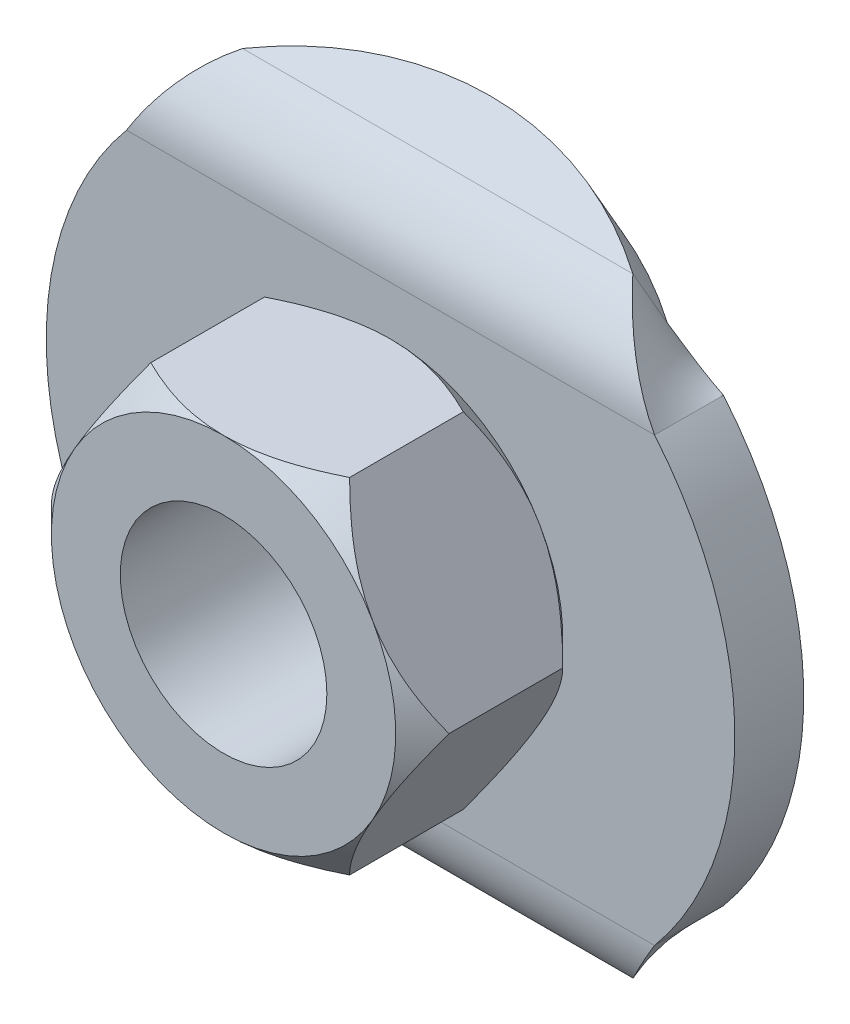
ISO-10303-21;
HEADER;
FILE_DESCRIPTION(('STEP AP214'),'2;1');
FILE_NAME('part.step','',(''),(''),'','','');
FILE_SCHEMA(('AUTOMOTIVE_DESIGN { 1 0 10303 214 1 1 1 1 }'));
ENDSEC;
DATA;
#1=APPLICATION_CONTEXT('core data for automotive mechanical design processes');
#2=APPLICATION_PROTOCOL_DEFINITION('international standard','automotive_design',2000,#1);
#3=PRODUCT_CONTEXT('',#1,'mechanical');
#4=PRODUCT('Part','Part','',(#3));
#5=PRODUCT_RELATED_PRODUCT_CATEGORY('part','',(#4));
#6=PRODUCT_DEFINITION_FORMATION('','',#4);
#7=PRODUCT_DEFINITION_CONTEXT('part definition',#1,'design');
#8=PRODUCT_DEFINITION('design','',#6,#7);
#9=PRODUCT_DEFINITION_SHAPE('','',#8);
#10=(LENGTH_UNIT() NAMED_UNIT(*) SI_UNIT(.MILLI.,.METRE.));
#11=(NAMED_UNIT(*) PLANE_ANGLE_UNIT() SI_UNIT($,.RADIAN.));
#12=(NAMED_UNIT(*) SI_UNIT($,.STERADIAN.) SOLID_ANGLE_UNIT());
#13=UNCERTAINTY_MEASURE_WITH_UNIT(LENGTH_MEASURE(1.E-05),#10,'distance_accuracy_value','');
#14=(GEOMETRIC_REPRESENTATION_CONTEXT(3) GLOBAL_UNCERTAINTY_ASSIGNED_CONTEXT((#13)) GLOBAL_UNIT_ASSIGNED_CONTEXT((#10,
#11,#12)) REPRESENTATION_CONTEXT('',''));
#15=CARTESIAN_POINT('',(0.,0.,0.));
#16=DIRECTION('',(0.,0.,1.));
#17=DIRECTION('',(1.,0.,0.));
#18=AXIS2_PLACEMENT_3D('',#15,#16,#17);
#19=CARTESIAN_POINT('',(0.,-4.67069511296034,7.7665252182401));
#20=DIRECTION('',(0.,0.866025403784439,-0.5));
#21=DIRECTION('',(0.,0.5,0.866025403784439));
#22=AXIS2_PLACEMENT_3D('',#19,#20,#21);
#23=PLANE('',#22);
#24=CARTESIAN_POINT('',(0.,-4.67069511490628,7.76652521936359));
#25=DIRECTION('',(0.,-0.866025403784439,0.5));
#26=DIRECTION('',(0.,-0.5,-0.866025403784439));
#27=AXIS2_PLACEMENT_3D('',#24,#25,#26);
#28=CIRCLE('',#27,10.);
#29=CARTESIAN_POINT('',(5.66795308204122,-8.78998837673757,0.631700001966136));
#30=VERTEX_POINT('',#29);
#31=CARTESIAN_POINT('',(-5.6679530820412,-8.78998837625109,0.63170000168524));
#32=VERTEX_POINT('',#31);
#33=EDGE_CURVE('E21',#30,#32,#28,.F.);
#34=ORIENTED_EDGE('',*,*,#33,.F.);
#35=DIRECTION('',(-1.,0.,0.));
#36=VECTOR('',#35,1.);
#37=CARTESIAN_POINT('',(15.5704970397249,-8.78998837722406,0.631700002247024));
#38=LINE('',#37,#36);
#39=EDGE_CURVE('E152',#32,#30,#38,.F.);
#40=ORIENTED_EDGE('',*,*,#39,.F.);
#41=EDGE_LOOP('',(#34,#40));
#42=FACE_BOUND('',#41,.T.);
#43=ADVANCED_FACE('F14',(#42),#23,.F.);
#44=CARTESIAN_POINT('',(0.,4.67069511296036,7.7665252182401));
#45=DIRECTION('',(0.,-0.866025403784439,-0.5));
#46=DIRECTION('',(0.,0.5,-0.866025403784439));
#47=AXIS2_PLACEMENT_3D('',#44,#45,#46);
#48=PLANE('',#47);
#49=CARTESIAN_POINT('',(0.,4.67069511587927,7.76652521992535));
#50=DIRECTION('',(0.,0.866025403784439,0.5));
#51=DIRECTION('',(0.,-0.5,0.866025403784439));
#52=AXIS2_PLACEMENT_3D('',#49,#50,#51);
#53=CIRCLE('',#52,10.);
#54=CARTESIAN_POINT('',(-5.6679530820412,8.7899883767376,0.631700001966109));
#55=VERTEX_POINT('',#54);
#56=CARTESIAN_POINT('',(5.66795308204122,8.7899883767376,0.631700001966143));
#57=VERTEX_POINT('',#56);
#58=EDGE_CURVE('E414',#55,#57,#53,.F.);
#59=ORIENTED_EDGE('',*,*,#58,.F.);
#60=DIRECTION('',(1.,0.,0.));
#61=VECTOR('',#60,1.);
#62=CARTESIAN_POINT('',(-15.570497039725,8.78998837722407,0.631700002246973));
#63=LINE('',#62,#61);
#64=EDGE_CURVE('E177',#57,#55,#63,.F.);
#65=ORIENTED_EDGE('',*,*,#64,.F.);
#66=EDGE_LOOP('',(#59,#65));
#67=FACE_BOUND('',#66,.T.);
#68=ADVANCED_FACE('F798',(#67),#48,.F.);
#69=CARTESIAN_POINT('',(4.3301270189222,2.50000000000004,2.00000000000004));
#70=DIRECTION('',(-0.866025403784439,-0.5,0.));
#71=DIRECTION('',(0.5,-0.866025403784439,0.));
#72=AXIS2_PLACEMENT_3D('',#69,#70,#71);
#73=PLANE('',#72);
#74=CARTESIAN_POINT('',(5.77350265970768,5.57522927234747E-08,6.07649734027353));
#75=CARTESIAN_POINT('',(5.72355103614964,0.0865188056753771,6.12644126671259));
#76=CARTESIAN_POINT('',(5.67321315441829,0.173706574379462,6.17484268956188));
#77=CARTESIAN_POINT('',(5.57168704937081,0.349554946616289,6.26808916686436));
#78=CARTESIAN_POINT('',(5.52049835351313,0.438216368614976,6.31293215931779));
#79=CARTESIAN_POINT('',(5.3650149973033,0.70752144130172,6.44183823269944));
#80=CARTESIAN_POINT('',(5.25939345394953,0.890463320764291,6.51967477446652));
#81=CARTESIAN_POINT('',(5.04779802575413,1.25695735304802,6.65181313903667));
#82=CARTESIAN_POINT('',(4.94192359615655,1.4403372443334,6.70673320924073));
#83=CARTESIAN_POINT('',(4.78141989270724,1.71833781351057,6.77027051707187));
#84=CARTESIAN_POINT('',(4.72770349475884,1.81137734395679,6.78829855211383));
#85=CARTESIAN_POINT('',(4.61982203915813,1.99823350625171,6.81767507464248));
#86=CARTESIAN_POINT('',(4.56565713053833,2.09204987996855,6.82902569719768));
#87=CARTESIAN_POINT('',(4.48127537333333,2.23820337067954,6.84123040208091));
#88=CARTESIAN_POINT('',(4.4511415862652,2.29039662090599,6.84450796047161));
#89=CARTESIAN_POINT('',(4.39071514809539,2.39505828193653,6.84889831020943));
#90=CARTESIAN_POINT('',(4.36042234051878,2.44752696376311,6.8500024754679));
#91=CARTESIAN_POINT('',(4.3301270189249,2.49999999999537,6.84999999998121));
#92=B_SPLINE_CURVE_WITH_KNOTS('',3,(#74,#75,#76,#77,#78,#79,#80,#81,#82,#83,#84,#85,#86,#87,#88,
#89,#90,#91),.UNSPECIFIED.,.F.,.F.,(4,2,2,2,2,2,2,2,4),(0.,0.335055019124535,0.670302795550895,
1.3447665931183,1.99962833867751,2.32625979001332,2.65278674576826,2.83382178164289,
3.01557389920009),.UNSPECIFIED.);
#93=CARTESIAN_POINT('',(5.77350267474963,2.60534545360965E-08,6.07649732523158));
#94=VERTEX_POINT('',#93);
#95=CARTESIAN_POINT('',(4.33012701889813,2.49999999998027,6.85000000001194));
#96=VERTEX_POINT('',#95);
#97=EDGE_CURVE('E589',#94,#96,#92,.T.);
#98=ORIENTED_EDGE('',*,*,#97,.F.);
#99=DIRECTION('',(0.,0.,1.));
#100=VECTOR('',#99,1.);
#101=CARTESIAN_POINT('',(5.77350268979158,-3.64538867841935E-09,2.));
#102=LINE('',#101,#100);
#103=CARTESIAN_POINT('',(5.77350268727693,-8.00088934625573E-09,2.77350268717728));
#104=VERTEX_POINT('',#103);
#105=EDGE_CURVE('E422',#94,#104,#102,.F.);
#106=ORIENTED_EDGE('',*,*,#105,.T.);
#107=CARTESIAN_POINT('',(4.33012701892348,2.49999999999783,1.99999999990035));
#108=CARTESIAN_POINT('',(4.36852433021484,2.43349390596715,1.99999385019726));
#109=CARTESIAN_POINT('',(4.40691590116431,2.36699775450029,2.00177011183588));
#110=CARTESIAN_POINT('',(4.48361249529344,2.23415535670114,2.00882952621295));
#111=CARTESIAN_POINT('',(4.52191753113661,2.16780908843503,2.01411212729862));
#112=CARTESIAN_POINT('',(4.63645730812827,1.96942037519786,2.03510572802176));
#113=CARTESIAN_POINT('',(4.71246899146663,1.83776427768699,2.05596298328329));
#114=CARTESIAN_POINT('',(4.86218746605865,1.57844427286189,2.10988785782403));
#115=CARTESIAN_POINT('',(4.93591172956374,1.45075010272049,2.14276657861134));
#116=CARTESIAN_POINT('',(5.08196139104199,1.19778466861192,2.21930455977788));
#117=CARTESIAN_POINT('',(5.15428634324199,1.07251417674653,2.26296719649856));
#118=CARTESIAN_POINT('',(5.2725695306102,0.867641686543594,2.34275564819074));
#119=CARTESIAN_POINT('',(5.3189801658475,0.787256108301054,2.37625057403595));
#120=CARTESIAN_POINT('',(5.41112169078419,0.627662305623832,2.44673792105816));
#121=CARTESIAN_POINT('',(5.45685272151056,0.548453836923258,2.48372960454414));
#122=CARTESIAN_POINT('',(5.54812146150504,0.39037174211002,2.56121717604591));
#123=CARTESIAN_POINT('',(5.5936522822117,0.311510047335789,2.60174534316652));
#124=CARTESIAN_POINT('',(5.68406034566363,0.154918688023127,2.68560854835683));
#125=CARTESIAN_POINT('',(5.72893763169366,0.0771889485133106,2.7289433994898));
#126=CARTESIAN_POINT('',(5.7735026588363,5.7261585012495E-08,2.77350265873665));
#127=B_SPLINE_CURVE_WITH_KNOTS('',3,(#107,#108,#109,#110,#111,#112,#113,#114,#115,#116,#117,
#118,#119,#120,#121,#122,#123,#124,#125,#126),.UNSPECIFIED.,.F.,.F.,(4,2,2,2,2,2,2,2,2,4),(0.,
0.230341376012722,0.460646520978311,0.920346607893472,1.37311358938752,1.82602250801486,
2.1219952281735,2.41790564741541,2.71687584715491,3.01582615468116),.UNSPECIFIED.);
#128=CARTESIAN_POINT('',(4.33012701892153,2.4999999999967,1.99999999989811));
#129=VERTEX_POINT('',#128);
#130=EDGE_CURVE('E545',#129,#104,#127,.T.);
#131=ORIENTED_EDGE('',*,*,#130,.F.);
#132=CARTESIAN_POINT('',(2.88675133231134,4.99999997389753,2.77350269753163));
#133=CARTESIAN_POINT('',(2.93670296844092,4.91348123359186,2.72355876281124));
#134=CARTESIAN_POINT('',(2.98704085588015,4.82629346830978,2.67515733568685));
#135=CARTESIAN_POINT('',(3.08856696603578,4.65044509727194,2.58191085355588));
#136=CARTESIAN_POINT('',(3.13975566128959,4.56178367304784,2.53706786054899));
#137=CARTESIAN_POINT('',(3.2952390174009,4.29247859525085,2.40816178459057));
#138=CARTESIAN_POINT('',(3.40086056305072,4.10953671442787,2.33032523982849));
#139=CARTESIAN_POINT('',(3.61245599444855,3.74304267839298,2.19818687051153));
#140=CARTESIAN_POINT('',(3.71833042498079,3.55966278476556,2.14326679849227));
#141=CARTESIAN_POINT('',(3.87883413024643,3.2816622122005,2.07972948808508));
#142=CARTESIAN_POINT('',(3.93255052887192,3.18862268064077,2.06170145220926));
#143=CARTESIAN_POINT('',(4.04043198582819,3.00176651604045,2.03232492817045));
#144=CARTESIAN_POINT('',(4.0945968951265,2.90795014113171,2.02097430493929));
#145=CARTESIAN_POINT('',(4.1789786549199,2.76179664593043,2.00876959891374));
#146=CARTESIAN_POINT('',(4.20911244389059,2.7096033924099,2.0054920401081));
#147=CARTESIAN_POINT('',(4.26953888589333,2.60494172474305,2.00110168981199));
#148=CARTESIAN_POINT('',(4.29983169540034,2.55247303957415,1.99999752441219));
#149=CARTESIAN_POINT('',(4.33012701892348,2.49999999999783,1.99999999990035));
#150=B_SPLINE_CURVE_WITH_KNOTS('',3,(#132,#133,#134,#135,#136,#137,#138,#139,#140,#141,#142,
#143,#144,#145,#146,#147,#148,#149),.UNSPECIFIED.,.F.,.F.,(4,2,2,2,2,2,2,2,4),(0.,
0.335055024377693,0.670302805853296,1.34476661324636,1.99962836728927,2.32625982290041,
2.65278678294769,2.83382183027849,3.01557395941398),.UNSPECIFIED.);
#151=CARTESIAN_POINT('',(2.88675135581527,4.99999999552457,2.7735026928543));
#152=VERTEX_POINT('',#151);
#153=EDGE_CURVE('E372',#152,#129,#150,.T.);
#154=ORIENTED_EDGE('',*,*,#153,.F.);
#155=DIRECTION('',(0.,0.,-1.));
#156=VECTOR('',#155,1.);
#157=CARTESIAN_POINT('',(2.88675136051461,5.,2.));
#158=LINE('',#157,#156);
#159=CARTESIAN_POINT('',(2.88675132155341,5.,6.07649732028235));
#160=VERTEX_POINT('',#159);
#161=EDGE_CURVE('E403',#152,#160,#158,.F.);
#162=ORIENTED_EDGE('',*,*,#161,.T.);
#163=CARTESIAN_POINT('',(4.3301270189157,2.49999999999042,6.84999999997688));
#164=CARTESIAN_POINT('',(4.29172970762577,2.56650609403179,6.85000614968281));
#165=CARTESIAN_POINT('',(4.25333813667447,2.63300224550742,6.84822988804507));
#166=CARTESIAN_POINT('',(4.17664154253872,2.76584464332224,6.84117047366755));
#167=CARTESIAN_POINT('',(4.13833650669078,2.83219091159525,6.83588787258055));
#168=CARTESIAN_POINT('',(4.02379672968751,3.03057962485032,6.81489427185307));
#169=CARTESIAN_POINT('',(3.94778504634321,3.16223572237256,6.79403701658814));
#170=CARTESIAN_POINT('',(3.79806657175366,3.42155572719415,6.74011214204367));
#171=CARTESIAN_POINT('',(3.72434230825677,3.54924989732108,6.70723342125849));
#172=CARTESIAN_POINT('',(3.5782926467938,3.80221533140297,6.63069544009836));
#173=CARTESIAN_POINT('',(3.50596769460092,3.9274858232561,6.58703280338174));
#174=CARTESIAN_POINT('',(3.38768450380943,4.13235831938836,6.50724434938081));
#175=CARTESIAN_POINT('',(3.34127386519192,4.21274390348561,6.47374942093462));
#176=CARTESIAN_POINT('',(3.24913233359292,4.37233771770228,6.40326206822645));
#177=CARTESIAN_POINT('',(3.20340129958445,4.4515461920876,6.36627038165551));
#178=CARTESIAN_POINT('',(3.11213255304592,4.60962829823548,6.28878280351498));
#179=CARTESIAN_POINT('',(3.06660172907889,4.68848999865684,6.24825463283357));
#180=CARTESIAN_POINT('',(2.97619365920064,4.8450813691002,6.16439142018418));
#181=CARTESIAN_POINT('',(2.93131637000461,4.92281111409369,6.12105656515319));
#182=CARTESIAN_POINT('',(2.88675133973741,5.00000001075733,6.07649730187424));
#183=B_SPLINE_CURVE_WITH_KNOTS('',3,(#163,#164,#165,#166,#167,#168,#169,#170,#171,#172,#173,
#174,#175,#176,#177,#178,#179,#180,#181,#182),.UNSPECIFIED.,.F.,.F.,(4,2,2,2,2,2,2,2,2,4),(0.,
0.230341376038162,0.460646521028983,0.920346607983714,1.37311358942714,1.82602250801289,
2.1219952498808,2.41790569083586,2.7168759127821,3.01582624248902),.UNSPECIFIED.);
#184=EDGE_CURVE('E607',#96,#160,#183,.T.);
#185=ORIENTED_EDGE('',*,*,#184,.F.);
#186=EDGE_LOOP('',(#98,#106,#131,#154,#162,#185));
#187=FACE_BOUND('',#186,.T.);
#188=ADVANCED_FACE('F564',(#187),#73,.F.);
#189=CARTESIAN_POINT('',(4.3301270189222,-2.49999999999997,2.));
#190=DIRECTION('',(-0.866025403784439,0.5,0.));
#191=DIRECTION('',(-0.5,-0.866025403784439,0.));
#192=AXIS2_PLACEMENT_3D('',#189,#190,#191);
#193=PLANE('',#192);
#194=CARTESIAN_POINT('',(2.8867513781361,-4.99999994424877,6.07649734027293));
#195=CARTESIAN_POINT('',(2.93670300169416,-4.91348119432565,6.12644126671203));
#196=CARTESIAN_POINT('',(2.98704088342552,-4.82629342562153,6.17484268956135));
#197=CARTESIAN_POINT('',(3.08856698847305,-4.65044505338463,6.2680891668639));
#198=CARTESIAN_POINT('',(3.13975568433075,-4.56178363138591,6.31293215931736));
#199=CARTESIAN_POINT('',(3.29523904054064,-4.29247855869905,6.44183823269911));
#200=CARTESIAN_POINT('',(3.40086058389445,-4.10953667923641,6.51967477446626));
#201=CARTESIAN_POINT('',(3.61245601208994,-3.74304264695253,6.6518131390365));
#202=CARTESIAN_POINT('',(3.71833044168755,-3.55966275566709,6.7067332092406));
#203=CARTESIAN_POINT('',(3.87883414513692,-3.28166218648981,6.7702705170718));
#204=CARTESIAN_POINT('',(3.93255054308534,-3.18862265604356,6.78829855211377));
#205=CARTESIAN_POINT('',(4.04043199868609,-3.00176649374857,6.81767507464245));
#206=CARTESIAN_POINT('',(4.09459690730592,-2.9079501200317,6.82902569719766));
#207=CARTESIAN_POINT('',(4.17897866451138,-2.76179662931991,6.84123040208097));
#208=CARTESIAN_POINT('',(4.20911245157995,-2.70960337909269,6.8445079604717));
#209=CARTESIAN_POINT('',(4.26953888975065,-2.60494171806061,6.84889831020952));
#210=CARTESIAN_POINT('',(4.29983169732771,-2.55247303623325,6.85000247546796));
#211=CARTESIAN_POINT('',(4.33012701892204,-2.50000000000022,6.84999999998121));
#212=B_SPLINE_CURVE_WITH_KNOTS('',3,(#194,#195,#196,#197,#198,#199,#200,#201,#202,#203,#204,
#205,#206,#207,#208,#209,#210,#211),.UNSPECIFIED.,.F.,.F.,(4,2,2,2,2,2,2,2,4),(0.,
0.33505501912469,0.670302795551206,1.34476659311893,1.99962833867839,2.32625979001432,
2.65278674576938,2.83382178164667,3.01557389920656),.UNSPECIFIED.);
#213=CARTESIAN_POINT('',(2.88675135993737,-4.99999997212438,6.0764973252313));
#214=VERTEX_POINT('',#213);
#215=CARTESIAN_POINT('',(4.33012701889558,-2.49999999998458,6.85000000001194));
#216=VERTEX_POINT('',#215);
#217=EDGE_CURVE('E571',#214,#216,#212,.T.);
#218=ORIENTED_EDGE('',*,*,#217,.F.);
#219=DIRECTION('',(0.,0.,1.));
#220=VECTOR('',#219,1.);
#221=CARTESIAN_POINT('',(2.88675134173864,-5.,2.));
#222=LINE('',#221,#220);
#223=CARTESIAN_POINT('',(2.88675133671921,-5.,2.77350268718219));
#224=VERTEX_POINT('',#223);
#225=EDGE_CURVE('E420',#214,#224,#222,.F.);
#226=ORIENTED_EDGE('',*,*,#225,.T.);
#227=CARTESIAN_POINT('',(4.33012701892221,-2.49999999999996,1.99999999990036));
#228=CARTESIAN_POINT('',(4.29172970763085,-2.56650609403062,1.99999385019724));
#229=CARTESIAN_POINT('',(4.2533381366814,-2.63300224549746,2.00177011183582));
#230=CARTESIAN_POINT('',(4.17664154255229,-2.76584464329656,2.0088295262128));
#231=CARTESIAN_POINT('',(4.13833650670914,-2.83219091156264,2.01411212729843));
#232=CARTESIAN_POINT('',(4.02379672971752,-3.03057962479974,2.03510572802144));
#233=CARTESIAN_POINT('',(3.94778504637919,-3.16223572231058,2.05596298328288));
#234=CARTESIAN_POINT('',(3.79806657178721,-3.42155572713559,2.10988785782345));
#235=CARTESIAN_POINT('',(3.72434230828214,-3.54924989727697,2.14276657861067));
#236=CARTESIAN_POINT('',(3.57829264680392,-3.80221533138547,2.21930455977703));
#237=CARTESIAN_POINT('',(3.50596769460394,-3.92748582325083,2.26296719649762));
#238=CARTESIAN_POINT('',(3.38768450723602,-4.13235831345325,2.34275564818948));
#239=CARTESIAN_POINT('',(3.341273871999,-4.21274389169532,2.37625057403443));
#240=CARTESIAN_POINT('',(3.24913234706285,-4.3723376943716,2.44673792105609));
#241=CARTESIAN_POINT('',(3.20340131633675,-4.45154616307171,2.48372960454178));
#242=CARTESIAN_POINT('',(3.11213257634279,-4.60962825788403,2.56121717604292));
#243=CARTESIAN_POINT('',(3.0666017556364,-4.68848995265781,2.6017453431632));
#244=CARTESIAN_POINT('',(2.97619369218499,-4.84508131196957,2.68560854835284));
#245=CARTESIAN_POINT('',(2.93131640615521,-4.92281105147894,2.72894339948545));
#246=CARTESIAN_POINT('',(2.88675137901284,-4.99999994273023,2.77350265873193));
#247=B_SPLINE_CURVE_WITH_KNOTS('',3,(#227,#228,#229,#230,#231,#232,#233,#234,#235,#236,#237,
#238,#239,#240,#241,#242,#243,#244,#245,#246),.UNSPECIFIED.,.F.,.F.,(4,2,2,2,2,2,2,2,2,4),(0.,
0.230341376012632,0.460646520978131,0.920346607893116,1.37311358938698,1.82602250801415,
2.12199522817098,2.41790564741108,2.71687584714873,3.01582615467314),.UNSPECIFIED.);
#248=CARTESIAN_POINT('',(4.33012701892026,-2.49999999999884,1.99999999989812));
#249=VERTEX_POINT('',#248);
#250=EDGE_CURVE('E536',#249,#224,#247,.T.);
#251=ORIENTED_EDGE('',*,*,#250,.F.);
#252=CARTESIAN_POINT('',(5.77350265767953,-3.74848374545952E-09,2.77350269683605));
#253=CARTESIAN_POINT('',(5.72355105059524,-0.0865187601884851,2.72355876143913));
#254=CARTESIAN_POINT('',(5.6732131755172,-0.173706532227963,2.67515733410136));
#255=CARTESIAN_POINT('',(5.57168707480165,-0.349554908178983,2.58191085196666));
#256=CARTESIAN_POINT('',(5.52049837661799,-0.438216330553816,2.53706785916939));
#257=CARTESIAN_POINT('',(5.36501501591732,-0.707521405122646,2.4081617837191));
#258=CARTESIAN_POINT('',(5.2593934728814,-0.890463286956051,2.33032523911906));
#259=CARTESIAN_POINT('',(5.04779804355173,-1.25695732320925,2.19818687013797));
#260=CARTESIAN_POINT('',(4.94192361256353,-1.44033721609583,2.14326679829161));
#261=CARTESIAN_POINT('',(4.78141990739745,-1.71833778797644,2.07972948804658));
#262=CARTESIAN_POINT('',(4.72770350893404,-1.81137731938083,2.06170145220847));
#263=CARTESIAN_POINT('',(4.61982205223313,-1.9982334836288,2.03232492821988));
#264=CARTESIAN_POINT('',(4.56565714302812,-2.09204985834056,2.0209743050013));
#265=CARTESIAN_POINT('',(4.481275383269,-2.23820335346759,2.00876959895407));
#266=CARTESIAN_POINT('',(4.45114159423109,-2.29039660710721,2.00549204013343));
#267=CARTESIAN_POINT('',(4.3907151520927,-2.39505827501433,2.0011016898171));
#268=CARTESIAN_POINT('',(4.36042234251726,-2.44752696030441,1.99999752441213));
#269=CARTESIAN_POINT('',(4.33012701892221,-2.49999999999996,1.99999999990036));
#270=B_SPLINE_CURVE_WITH_KNOTS('',3,(#252,#253,#254,#255,#256,#257,#258,#259,#260,#261,#262,
#263,#264,#265,#266,#267,#268,#269),.UNSPECIFIED.,.F.,.F.,(4,2,2,2,2,2,2,2,4),(0.,
0.335055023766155,0.670302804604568,1.34476661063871,1.99962836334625,2.32625981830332,
2.65278677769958,2.8338218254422,3.01557395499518),.UNSPECIFIED.);
#271=EDGE_CURVE('E178',#104,#249,#270,.T.);
#272=ORIENTED_EDGE('',*,*,#271,.F.);
#273=ORIENTED_EDGE('',*,*,#105,.F.);
#274=CARTESIAN_POINT('',(4.33012701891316,-2.49999999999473,6.84999999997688));
#275=CARTESIAN_POINT('',(4.36852433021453,-2.4334939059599,6.85000614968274));
#276=CARTESIAN_POINT('',(4.4069159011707,-2.36699775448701,6.84822988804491));
#277=CARTESIAN_POINT('',(4.48361249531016,-2.2341553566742,6.84117047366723));
#278=CARTESIAN_POINT('',(4.52191753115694,-2.16780908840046,6.83588787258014));
#279=CARTESIAN_POINT('',(4.63645730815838,-1.96942037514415,6.8148942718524));
#280=CARTESIAN_POINT('',(4.71246899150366,-1.83776427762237,6.79403701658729));
#281=CARTESIAN_POINT('',(4.86218746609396,-1.57844427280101,6.74011214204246));
#282=CARTESIAN_POINT('',(4.93591172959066,-1.45075010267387,6.7072334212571));
#283=CARTESIAN_POINT('',(5.08196139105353,-1.19778466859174,6.63069544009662));
#284=CARTESIAN_POINT('',(5.15428634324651,-1.07251417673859,6.58703280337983));
#285=CARTESIAN_POINT('',(5.27256953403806,-0.867641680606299,6.50724434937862));
#286=CARTESIAN_POINT('',(5.31898017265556,-0.787256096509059,6.47374942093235));
#287=CARTESIAN_POINT('',(5.41112170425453,-0.627662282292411,6.40326206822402));
#288=CARTESIAN_POINT('',(5.45685273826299,-0.548453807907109,6.36627038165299));
#289=CARTESIAN_POINT('',(5.54812148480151,-0.390371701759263,6.28878280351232));
#290=CARTESIAN_POINT('',(5.59365230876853,-0.311510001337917,6.24825463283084));
#291=CARTESIAN_POINT('',(5.68406037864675,-0.154918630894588,6.16439142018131));
#292=CARTESIAN_POINT('',(5.72893766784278,-0.0771888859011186,6.12105656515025));
#293=CARTESIAN_POINT('',(5.77350269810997,1.07625054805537E-08,6.07649730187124));
#294=B_SPLINE_CURVE_WITH_KNOTS('',3,(#274,#275,#276,#277,#278,#279,#280,#281,#282,#283,#284,
#285,#286,#287,#288,#289,#290,#291,#292,#293),.UNSPECIFIED.,.F.,.F.,(4,2,2,2,2,2,2,2,2,4),(0.,
0.230341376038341,0.460646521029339,0.920346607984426,1.37311358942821,1.82602250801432,
2.12199524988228,2.41790569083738,2.71687591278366,3.01582624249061),.UNSPECIFIED.);
#295=EDGE_CURVE('E581',#216,#94,#294,.T.);
#296=ORIENTED_EDGE('',*,*,#295,.F.);
#297=EDGE_LOOP('',(#218,#226,#251,#272,#273,#296));
#298=FACE_BOUND('',#297,.T.);
#299=ADVANCED_FACE('F560',(#298),#193,.F.);
#300=CARTESIAN_POINT('',(0.,-5.,2.));
#301=DIRECTION('',(0.,1.,0.));
#302=DIRECTION('',(0.,0.,1.));
#303=AXIS2_PLACEMENT_3D('',#300,#301,#302);
#304=PLANE('',#303);
#305=CARTESIAN_POINT('',(-2.88675128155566,-5.,6.07649734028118));
#306=CARTESIAN_POINT('',(-2.78684803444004,-4.99999999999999,6.12644126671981));
#307=CARTESIAN_POINT('',(-2.68617227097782,-4.99999999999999,6.17484268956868));
#308=CARTESIAN_POINT('',(-2.4831200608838,-4.99999999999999,6.26808916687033));
#309=CARTESIAN_POINT('',(-2.38074266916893,-4.99999999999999,6.31293215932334));
#310=CARTESIAN_POINT('',(-2.06977595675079,-4.99999999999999,6.44183823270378));
#311=CARTESIAN_POINT('',(-1.85853287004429,-4.99999999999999,6.51967477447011));
#312=CARTESIAN_POINT('',(-1.43534201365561,-4.99999999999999,6.65181313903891));
#313=CARTESIAN_POINT('',(-1.22359315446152,-4.99999999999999,6.70673320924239));
#314=CARTESIAN_POINT('',(-0.902585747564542,-4.99999999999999,6.77027051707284));
#315=CARTESIAN_POINT('',(-0.795152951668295,-4.99999999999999,6.78829855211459));
#316=CARTESIAN_POINT('',(-0.579390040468,-4.99999999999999,6.8176750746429));
#317=CARTESIAN_POINT('',(-0.47106022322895,-5.,6.82902569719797));
#318=CARTESIAN_POINT('',(-0.302296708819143,-5.,6.8412304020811));
#319=CARTESIAN_POINT('',(-0.242029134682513,-4.99999999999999,6.84450796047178));
#320=CARTESIAN_POINT('',(-0.121176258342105,-4.99999999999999,6.84889831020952));
#321=CARTESIAN_POINT('',(-0.0605906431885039,-4.99999999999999,6.85000247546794));
#322=CARTESIAN_POINT('',(-3.39730910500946E-13,-5.,6.84999999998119));
#323=B_SPLINE_CURVE_WITH_KNOTS('',3,(#305,#306,#307,#308,#309,#310,#311,#312,#313,#314,#315,
#316,#317,#318,#319,#320,#321,#322),.UNSPECIFIED.,.F.,.F.,(4,2,2,2,2,2,2,2,4),(0.,
0.33505501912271,0.670302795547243,1.34476659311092,1.99962833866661,2.32625979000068,
2.65278674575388,2.83382178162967,3.01557389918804),.UNSPECIFIED.);
#324=CARTESIAN_POINT('',(-2.88675131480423,-4.99999999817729,6.07649732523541));
#325=VERTEX_POINT('',#324);
#326=CARTESIAN_POINT('',(0.,-4.99999999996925,6.85000000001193));
#327=VERTEX_POINT('',#326);
#328=EDGE_CURVE('E663',#325,#327,#323,.T.);
#329=ORIENTED_EDGE('',*,*,#328,.F.);
#330=DIRECTION('',(0.,0.,1.));
#331=VECTOR('',#330,1.);
#332=CARTESIAN_POINT('',(-2.8867513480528,-4.99999999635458,2.));
#333=LINE('',#332,#331);
#334=CARTESIAN_POINT('',(-2.8867513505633,-4.99999999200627,2.77350268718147));
#335=VERTEX_POINT('',#334);
#336=EDGE_CURVE('E418',#325,#335,#333,.F.);
#337=ORIENTED_EDGE('',*,*,#336,.T.);
#338=CARTESIAN_POINT('',(0.,-5.,1.99999999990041));
#339=CARTESIAN_POINT('',(-0.0767946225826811,-5.,1.99999385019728));
#340=CARTESIAN_POINT('',(-0.153577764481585,-5.,2.00177011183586));
#341=CARTESIAN_POINT('',(-0.306970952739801,-5.,2.00882952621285));
#342=CARTESIAN_POINT('',(-0.383581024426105,-5.,2.01411212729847));
#343=CARTESIAN_POINT('',(-0.612660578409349,-5.,2.03510572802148));
#344=CARTESIAN_POINT('',(-0.764683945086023,-5.,2.05596298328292));
#345=CARTESIAN_POINT('',(-1.06412089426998,-5.,2.10988785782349));
#346=CARTESIAN_POINT('',(-1.21156942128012,-5.,2.14276657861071));
#347=CARTESIAN_POINT('',(-1.50366874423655,-5.,2.21930455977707));
#348=CARTESIAN_POINT('',(-1.64831864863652,-5.,2.26296719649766));
#349=CARTESIAN_POINT('',(-1.88488502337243,-5.,2.34275564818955));
#350=CARTESIAN_POINT('',(-1.97770629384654,-5.,2.37625057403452));
#351=CARTESIAN_POINT('',(-2.16198934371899,-5.,2.44673792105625));
#352=CARTESIAN_POINT('',(-2.25345140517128,-5.,2.48372960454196));
#353=CARTESIAN_POINT('',(-2.43598888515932,-5.,2.56121717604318));
#354=CARTESIAN_POINT('',(-2.52705052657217,-5.,2.6017453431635));
#355=CARTESIAN_POINT('',(-2.70786665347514,-5.,2.68560854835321));
#356=CARTESIAN_POINT('',(-2.79762122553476,-5.,2.72894339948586));
#357=CARTESIAN_POINT('',(-2.88675127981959,-5.,2.77350265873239));
#358=B_SPLINE_CURVE_WITH_KNOTS('',3,(#338,#339,#340,#341,#342,#343,#344,#345,#346,#347,#348,
#349,#350,#351,#352,#353,#354,#355,#356,#357),.UNSPECIFIED.,.F.,.F.,(4,2,2,2,2,2,2,2,2,4),(0.,
0.230341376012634,0.460646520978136,0.920346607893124,1.373113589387,1.82602250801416,
2.12199522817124,2.41790564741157,2.71687584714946,3.01582615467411),.UNSPECIFIED.);
#359=CARTESIAN_POINT('',(0.,-4.99999999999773,1.99999999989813));
#360=VERTEX_POINT('',#359);
#361=EDGE_CURVE('E533',#360,#335,#358,.T.);
#362=ORIENTED_EDGE('',*,*,#361,.F.);
#363=CARTESIAN_POINT('',(2.88675132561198,-4.9999999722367,2.77350269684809));
#364=CARTESIAN_POINT('',(2.78684808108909,-4.999999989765,2.72355876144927));
#365=CARTESIAN_POINT('',(2.68617231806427,-4.99999999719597,2.67515733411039));
#366=CARTESIAN_POINT('',(2.48312010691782,-5.00000000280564,2.58191085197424));
#367=CARTESIAN_POINT('',(2.38074271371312,-5.00000000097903,2.53706785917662));
#368=CARTESIAN_POINT('',(2.06977599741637,-4.99999999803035,2.40816178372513));
#369=CARTESIAN_POINT('',(1.85853290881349,-4.9999999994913,2.33032523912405));
#370=CARTESIAN_POINT('',(1.43534204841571,-5.00000000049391,2.19818687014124));
#371=CARTESIAN_POINT('',(1.22359318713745,-5.00000000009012,2.14326679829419));
#372=CARTESIAN_POINT('',(0.902585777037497,-4.99999999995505,2.07972948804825));
#373=CARTESIAN_POINT('',(0.795152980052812,-4.99999999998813,2.06170145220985));
#374=CARTESIAN_POINT('',(0.579390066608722,-5.00000000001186,2.03232492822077));
#375=CARTESIAN_POINT('',(0.471060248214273,-5.00000000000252,2.02097430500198));
#376=CARTESIAN_POINT('',(0.302296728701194,-4.9999999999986,2.00876959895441));
#377=CARTESIAN_POINT('',(0.242029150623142,-4.9999999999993,2.00549204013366));
#378=CARTESIAN_POINT('',(0.121176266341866,-5.0000000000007,2.00110168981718));
#379=CARTESIAN_POINT('',(0.0605906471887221,-5.00000000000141,1.99999752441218));
#380=CARTESIAN_POINT('',(0.,-5.,1.99999999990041));
#381=B_SPLINE_CURVE_WITH_KNOTS('',3,(#363,#364,#365,#366,#367,#368,#369,#370,#371,#372,#373,
#374,#375,#376,#377,#378,#379,#380),.UNSPECIFIED.,.F.,.F.,(4,2,2,2,2,2,2,2,4),(0.,
0.335055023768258,0.670302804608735,1.34476661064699,1.99962836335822,2.32625981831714,
2.65278677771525,2.83382182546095,3.01557395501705),.UNSPECIFIED.);
#382=EDGE_CURVE('E543',#224,#360,#381,.T.);
#383=ORIENTED_EDGE('',*,*,#382,.F.);
#384=ORIENTED_EDGE('',*,*,#225,.F.);
#385=CARTESIAN_POINT('',(0.,-4.99999999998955,6.84999999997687));
#386=CARTESIAN_POINT('',(0.0767946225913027,-4.99999999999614,6.85000614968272));
#387=CARTESIAN_POINT('',(0.153577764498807,-4.99999999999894,6.8482298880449));
#388=CARTESIAN_POINT('',(0.306970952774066,-5.00000000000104,6.84117047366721));
#389=CARTESIAN_POINT('',(0.383581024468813,-5.00000000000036,6.83588787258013));
#390=CARTESIAN_POINT('',(0.612660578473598,-4.99999999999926,6.81489427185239));
#391=CARTESIAN_POINT('',(0.764683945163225,-4.9999999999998,6.79403701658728));
#392=CARTESIAN_POINT('',(1.06412089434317,-5.00000000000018,6.74011214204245));
#393=CARTESIAN_POINT('',(1.2115694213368,-5.00000000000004,6.7072334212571));
#394=CARTESIAN_POINT('',(1.50366874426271,-4.99999999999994,6.63069544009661));
#395=CARTESIAN_POINT('',(1.64831864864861,-4.99999999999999,6.58703280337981));
#396=CARTESIAN_POINT('',(1.88488503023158,-5.00000000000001,6.50724434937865));
#397=CARTESIAN_POINT('',(1.97770630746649,-4.99999999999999,6.47374942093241));
#398=CARTESIAN_POINT('',(2.16198937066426,-4.99999999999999,6.40326206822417));
#399=CARTESIAN_POINT('',(2.25345143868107,-4.99999999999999,6.36627038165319));
#400=CARTESIAN_POINT('',(2.43598893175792,-4.99999999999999,6.28878280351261));
#401=CARTESIAN_POINT('',(2.52705057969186,-4.99999999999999,6.24825463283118));
#402=CARTESIAN_POINT('',(2.70786671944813,-4.99999999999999,6.16439142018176));
#403=CARTESIAN_POINT('',(2.79762129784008,-4.99999999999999,6.12105656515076));
#404=CARTESIAN_POINT('',(2.88675135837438,-5.,6.07649730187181));
#405=B_SPLINE_CURVE_WITH_KNOTS('',3,(#385,#386,#387,#388,#389,#390,#391,#392,#393,#394,#395,
#396,#397,#398,#399,#400,#401,#402,#403,#404),.UNSPECIFIED.,.F.,.F.,(4,2,2,2,2,2,2,2,2,4),(0.,
0.230341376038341,0.460646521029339,0.920346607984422,1.37311358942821,1.82602250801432,
2.12199524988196,2.41790569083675,2.7168759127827,3.01582624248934),.UNSPECIFIED.);
#406=EDGE_CURVE('E652',#327,#214,#405,.T.);
#407=ORIENTED_EDGE('',*,*,#406,.F.);
#408=EDGE_LOOP('',(#329,#337,#362,#383,#384,#407));
#409=FACE_BOUND('',#408,.T.);
#410=ADVANCED_FACE('F563',(#409),#304,.F.);
#411=CARTESIAN_POINT('',(-4.33012701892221,-2.49999999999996,2.));
#412=DIRECTION('',(0.866025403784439,0.5,0.));
#413=DIRECTION('',(-0.5,0.866025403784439,0.));
#414=AXIS2_PLACEMENT_3D('',#411,#412,#413);
#415=PLANE('',#414);
#416=CARTESIAN_POINT('',(-5.77350265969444,-5.57751710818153E-08,6.0764973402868));
#417=CARTESIAN_POINT('',(-5.7235510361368,-0.0865188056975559,6.12644126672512));
#418=CARTESIAN_POINT('',(-5.67321315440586,-0.173706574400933,6.17484268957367));
#419=CARTESIAN_POINT('',(-5.5716870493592,-0.349554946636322,6.26808916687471));
#420=CARTESIAN_POINT('',(-5.52049835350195,-0.43821636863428,6.31293215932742));
#421=CARTESIAN_POINT('',(-5.36501499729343,-0.707521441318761,6.44183823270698));
#422=CARTESIAN_POINT('',(-5.25939345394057,-0.89046332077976,6.51967477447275));
#423=CARTESIAN_POINT('',(-5.04779802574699,-1.25695735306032,6.65181313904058));
#424=CARTESIAN_POINT('',(-4.94192359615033,-1.44033724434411,6.70673320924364));
#425=CARTESIAN_POINT('',(-4.78141989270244,-1.71833781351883,6.77027051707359));
#426=CARTESIAN_POINT('',(-4.72770349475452,-1.81137734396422,6.78829855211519));
#427=CARTESIAN_POINT('',(-4.61982203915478,-1.99823350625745,6.81767507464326));
#428=CARTESIAN_POINT('',(-4.56565713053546,-2.09204987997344,6.82902569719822));
#429=CARTESIAN_POINT('',(-4.48127537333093,-2.23820337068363,6.84123040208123));
#430=CARTESIAN_POINT('',(-4.45114158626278,-2.29039662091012,6.84450796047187));
#431=CARTESIAN_POINT('',(-4.39071514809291,-2.39505828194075,6.84889831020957));
#432=CARTESIAN_POINT('',(-4.36042234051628,-2.44752696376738,6.85000247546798));
#433=CARTESIAN_POINT('',(-4.33012701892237,-2.49999999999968,6.84999999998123));
#434=B_SPLINE_CURVE_WITH_KNOTS('',3,(#416,#417,#418,#419,#420,#421,#422,#423,#424,#425,#426,
#427,#428,#429,#430,#431,#432,#433),.UNSPECIFIED.,.F.,.F.,(4,2,2,2,2,2,2,2,4),(0.,
0.335055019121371,0.670302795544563,1.3447665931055,1.99962833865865,2.32625978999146,
2.65278674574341,2.83382178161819,3.01557389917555),.UNSPECIFIED.);
#435=CARTESIAN_POINT('',(-5.77350267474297,-2.60647740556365E-08,6.07649732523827));
#436=VERTEX_POINT('',#435);
#437=CARTESIAN_POINT('',(-4.33012701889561,-2.4999999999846,6.85000000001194));
#438=VERTEX_POINT('',#437);
#439=EDGE_CURVE('E666',#436,#438,#434,.T.);
#440=ORIENTED_EDGE('',*,*,#439,.F.);
#441=DIRECTION('',(0.,0.,1.));
#442=VECTOR('',#441,1.);
#443=CARTESIAN_POINT('',(-5.7735026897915,3.64561766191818E-09,2.));
#444=LINE('',#443,#442);
#445=CARTESIAN_POINT('',(-5.77350268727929,7.99688154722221E-09,2.77350268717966));
#446=VERTEX_POINT('',#445);
#447=EDGE_CURVE('E400',#436,#446,#444,.F.);
#448=ORIENTED_EDGE('',*,*,#447,.T.);
#449=CARTESIAN_POINT('',(-4.33012701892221,-2.49999999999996,1.99999999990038));
#450=CARTESIAN_POINT('',(-4.36852433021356,-2.4334939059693,1.99999385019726));
#451=CARTESIAN_POINT('',(-4.40691590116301,-2.36699775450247,2.00177011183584));
#452=CARTESIAN_POINT('',(-4.48361249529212,-2.23415535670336,2.00882952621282));
#453=CARTESIAN_POINT('',(-4.52191753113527,-2.16780908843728,2.01411212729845));
#454=CARTESIAN_POINT('',(-4.63645730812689,-1.96942037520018,2.03510572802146));
#455=CARTESIAN_POINT('',(-4.71246899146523,-1.83776427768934,2.0559629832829));
#456=CARTESIAN_POINT('',(-4.86218746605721,-1.57844427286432,2.10988785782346));
#457=CARTESIAN_POINT('',(-4.93591172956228,-1.45075010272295,2.14276657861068));
#458=CARTESIAN_POINT('',(-5.08196139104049,-1.19778466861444,2.21930455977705));
#459=CARTESIAN_POINT('',(-5.15428634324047,-1.07251417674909,2.26296719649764));
#460=CARTESIAN_POINT('',(-5.2725695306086,-0.867641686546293,2.34275564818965));
#461=CARTESIAN_POINT('',(-5.31898016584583,-0.787256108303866,2.37625057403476));
#462=CARTESIAN_POINT('',(-5.41112169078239,-0.627662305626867,2.44673792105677));
#463=CARTESIAN_POINT('',(-5.4568527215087,-0.548453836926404,2.48372960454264));
#464=CARTESIAN_POINT('',(-5.54812146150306,-0.390371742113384,2.5612171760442));
#465=CARTESIAN_POINT('',(-5.59365228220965,-0.311510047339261,2.60174534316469));
#466=CARTESIAN_POINT('',(-5.68406034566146,-0.154918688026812,2.68560854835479));
#467=CARTESIAN_POINT('',(-5.72893763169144,-0.0771889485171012,2.72894339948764));
#468=CARTESIAN_POINT('',(-5.77350265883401,-5.72654808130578E-08,2.77350265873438));
#469=B_SPLINE_CURVE_WITH_KNOTS('',3,(#449,#450,#451,#452,#453,#454,#455,#456,#457,#458,#459,
#460,#461,#462,#463,#464,#465,#466,#467,#468),.UNSPECIFIED.,.F.,.F.,(4,2,2,2,2,2,2,2,2,4),(0.,
0.230341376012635,0.460646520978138,0.920346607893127,1.373113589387,1.82602250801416,
2.12199522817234,2.41790564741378,2.7168758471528,3.01582615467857),.UNSPECIFIED.);
#470=CARTESIAN_POINT('',(-4.33012701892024,-2.49999999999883,1.99999999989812));
#471=VERTEX_POINT('',#470);
#472=EDGE_CURVE('E345',#471,#446,#469,.T.);
#473=ORIENTED_EDGE('',*,*,#472,.F.);
#474=CARTESIAN_POINT('',(-2.88675133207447,-4.99999996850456,2.77350269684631));
#475=CARTESIAN_POINT('',(-2.93670296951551,-4.9134812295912,2.72355876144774));
#476=CARTESIAN_POINT('',(-2.98704085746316,-4.82629346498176,2.67515733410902));
#477=CARTESIAN_POINT('',(-3.08856696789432,-4.65044509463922,2.58191085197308));
#478=CARTESIAN_POINT('',(-3.13975566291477,-4.56178367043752,2.53706785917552));
#479=CARTESIAN_POINT('',(-3.29523901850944,-4.29247859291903,2.40816178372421));
#480=CARTESIAN_POINT('',(-3.40086056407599,-4.10953671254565,2.33032523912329));
#481=CARTESIAN_POINT('',(-3.61245599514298,-3.74304267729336,2.19818687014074));
#482=CARTESIAN_POINT('',(-3.71833042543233,-3.55966278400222,2.14326679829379));
#483=CARTESIAN_POINT('',(-3.8788341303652,-3.28166221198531,2.07972948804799));
#484=CARTESIAN_POINT('',(-3.93255052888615,-3.18862268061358,2.06170145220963));
#485=CARTESIAN_POINT('',(-4.04043198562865,-3.00176651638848,2.03232492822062));
#486=CARTESIAN_POINT('',(-4.09459689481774,-2.90795014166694,2.02097430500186));
#487=CARTESIAN_POINT('',(-4.17897865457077,-2.76179664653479,2.00876959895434));
#488=CARTESIAN_POINT('',(-4.20911244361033,-2.7096033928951,2.00549204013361));
#489=CARTESIAN_POINT('',(-4.26953888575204,-2.60494172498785,2.00110168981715));
#490=CARTESIAN_POINT('',(-4.29983169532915,-2.5524730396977,1.99999752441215));
#491=CARTESIAN_POINT('',(-4.33012701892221,-2.49999999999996,1.99999999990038));
#492=B_SPLINE_CURVE_WITH_KNOTS('',3,(#474,#475,#476,#477,#478,#479,#480,#481,#482,#483,#484,
#485,#486,#487,#488,#489,#490,#491),.UNSPECIFIED.,.F.,.F.,(4,2,2,2,2,2,2,2,4),(0.,
0.335055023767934,0.670302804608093,1.34476661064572,1.99962836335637,2.326259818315,
2.65278677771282,2.8338218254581,3.01557395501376),.UNSPECIFIED.);
#493=EDGE_CURVE('E530',#335,#471,#492,.T.);
#494=ORIENTED_EDGE('',*,*,#493,.F.);
#495=ORIENTED_EDGE('',*,*,#336,.F.);
#496=CARTESIAN_POINT('',(-4.33012701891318,-2.49999999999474,6.8499999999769));
#497=CARTESIAN_POINT('',(-4.29172970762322,-2.56650609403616,6.85000614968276));
#498=CARTESIAN_POINT('',(-4.25333813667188,-2.63300224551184,6.84822988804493));
#499=CARTESIAN_POINT('',(-4.17664154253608,-2.76584464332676,6.84117047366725));
#500=CARTESIAN_POINT('',(-4.13833650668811,-2.83219091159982,6.83588787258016));
#501=CARTESIAN_POINT('',(-4.02379672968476,-3.03057962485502,6.81489427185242));
#502=CARTESIAN_POINT('',(-3.94778504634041,-3.16223572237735,6.79403701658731));
#503=CARTESIAN_POINT('',(-3.79806657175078,-3.42155572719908,6.74011214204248));
#504=CARTESIAN_POINT('',(-3.72434230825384,-3.54924989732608,6.70723342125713));
#505=CARTESIAN_POINT('',(-3.5782926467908,-3.8022153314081,6.63069544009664));
#506=CARTESIAN_POINT('',(-3.50596769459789,-3.9274858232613,6.58703280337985));
#507=CARTESIAN_POINT('',(-3.38768450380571,-4.13235831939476,6.5072443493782));
#508=CARTESIAN_POINT('',(-3.34127386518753,-4.21274390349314,6.47374942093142));
#509=CARTESIAN_POINT('',(-3.24913233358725,-4.37233771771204,6.40326206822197));
#510=CARTESIAN_POINT('',(-3.20340129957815,-4.45154619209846,6.36627038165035));
#511=CARTESIAN_POINT('',(-3.11213255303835,-4.60962829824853,6.28878280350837));
#512=CARTESIAN_POINT('',(-3.06660172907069,-4.68848999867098,6.2482546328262));
#513=CARTESIAN_POINT('',(-2.97619365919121,-4.84508136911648,6.16439142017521));
#514=CARTESIAN_POINT('',(-2.93131636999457,-4.92281111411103,6.12105656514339));
#515=CARTESIAN_POINT('',(-2.88675133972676,-5.00000001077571,6.07649730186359));
#516=B_SPLINE_CURVE_WITH_KNOTS('',3,(#496,#497,#498,#499,#500,#501,#502,#503,#504,#505,#506,
#507,#508,#509,#510,#511,#512,#513,#514,#515),.UNSPECIFIED.,.F.,.F.,(4,2,2,2,2,2,2,2,2,4),(0.,
0.230341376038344,0.460646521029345,0.920346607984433,1.37311358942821,1.8260225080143,
2.12199524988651,2.41790569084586,2.71687591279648,3.01582624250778),.UNSPECIFIED.);
#517=EDGE_CURVE('E662',#438,#325,#516,.T.);
#518=ORIENTED_EDGE('',*,*,#517,.F.);
#519=EDGE_LOOP('',(#440,#448,#473,#494,#495,#518));
#520=FACE_BOUND('',#519,.T.);
#521=ADVANCED_FACE('F317',(#520),#415,.F.);
#522=CARTESIAN_POINT('',(0.,5.,2.));
#523=DIRECTION('',(0.,-1.,0.));
#524=DIRECTION('',(0.,0.,-1.));
#525=AXIS2_PLACEMENT_3D('',#522,#523,#524);
#526=PLANE('',#525);
#527=CARTESIAN_POINT('',(2.88675128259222,5.,6.07649733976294));
#528=CARTESIAN_POINT('',(2.78684803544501,5.00000000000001,6.12644126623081));
#529=CARTESIAN_POINT('',(2.68617227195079,5.00000000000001,6.17484268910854));
#530=CARTESIAN_POINT('',(2.48312006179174,5.00000000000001,6.26808916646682));
#531=CARTESIAN_POINT('',(2.38074267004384,5.00000000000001,6.31293215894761));
#532=CARTESIAN_POINT('',(2.06977595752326,5.00000000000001,6.44183823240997));
#533=CARTESIAN_POINT('',(1.85853287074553,5.00000000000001,6.51967477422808));
#534=CARTESIAN_POINT('',(1.43534201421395,5.00000000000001,6.65181313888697));
#535=CARTESIAN_POINT('',(1.22359315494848,5.00000000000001,6.7067332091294));
#536=CARTESIAN_POINT('',(0.902585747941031,5.00000000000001,6.77027051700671));
#537=CARTESIAN_POINT('',(0.795152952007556,5.00000000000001,6.78829855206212));
#538=CARTESIAN_POINT('',(0.579390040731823,5.00000000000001,6.81767507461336));
#539=CARTESIAN_POINT('',(0.471060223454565,5.,6.82902569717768));
#540=CARTESIAN_POINT('',(0.302296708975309,5.,6.8412304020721));
#541=CARTESIAN_POINT('',(0.242029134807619,5.00000000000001,6.84450796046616));
#542=CARTESIAN_POINT('',(0.121176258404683,5.00000000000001,6.84889831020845));
#543=CARTESIAN_POINT('',(0.0605906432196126,5.00000000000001,6.85000247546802));
#544=CARTESIAN_POINT('',(0.,5.,6.84999999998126));
#545=B_SPLINE_CURVE_WITH_KNOTS('',3,(#527,#528,#529,#530,#531,#532,#533,#534,#535,#536,#537,
#538,#539,#540,#541,#542,#543,#544),.UNSPECIFIED.,.F.,.F.,(4,2,2,2,2,2,2,2,4),(0.,
0.335055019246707,0.670302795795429,1.34476659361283,1.99962833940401,2.32625979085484,
2.6527867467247,2.83382178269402,3.01557390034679),.UNSPECIFIED.);
#546=CARTESIAN_POINT('',(0.,5.,6.84999999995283));
#547=VERTEX_POINT('',#546);
#548=EDGE_CURVE('E327',#160,#547,#545,.T.);
#549=ORIENTED_EDGE('',*,*,#548,.F.);
#550=ORIENTED_EDGE('',*,*,#161,.F.);
#551=CARTESIAN_POINT('',(0.,5.,1.99999999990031));
#552=CARTESIAN_POINT('',(0.0767946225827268,5.,1.99999385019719));
#553=CARTESIAN_POINT('',(0.153577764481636,5.,2.00177011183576));
#554=CARTESIAN_POINT('',(0.306970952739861,5.,2.00882952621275));
#555=CARTESIAN_POINT('',(0.38358102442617,5.,2.01411212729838));
#556=CARTESIAN_POINT('',(0.612660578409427,5.,2.03510572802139));
#557=CARTESIAN_POINT('',(0.764683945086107,5.,2.05596298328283));
#558=CARTESIAN_POINT('',(1.06412089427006,5.,2.1098878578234));
#559=CARTESIAN_POINT('',(1.21156942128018,5.,2.14276657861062));
#560=CARTESIAN_POINT('',(1.50366874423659,5.,2.21930455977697));
#561=CARTESIAN_POINT('',(1.64831864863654,5.,2.26296719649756));
#562=CARTESIAN_POINT('',(1.88488502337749,5.,2.34275564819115));
#563=CARTESIAN_POINT('',(1.97770629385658,5.,2.37625057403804));
#564=CARTESIAN_POINT('',(2.16198934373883,5.,2.44673792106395));
#565=CARTESIAN_POINT('',(2.25345140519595,5.,2.48372960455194));
#566=CARTESIAN_POINT('',(2.43598888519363,5.,2.56121717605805));
#567=CARTESIAN_POINT('',(2.52705052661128,5.,2.60174534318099));
#568=CARTESIAN_POINT('',(2.70786665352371,5.,2.68560854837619));
#569=CARTESIAN_POINT('',(2.79762122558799,5.,2.72894339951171));
#570=CARTESIAN_POINT('',(2.88675127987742,5.,2.77350265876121));
#571=B_SPLINE_CURVE_WITH_KNOTS('',3,(#551,#552,#553,#554,#555,#556,#557,#558,#559,#560,#561,
#562,#563,#564,#565,#566,#567,#568,#569,#570),.UNSPECIFIED.,.F.,.F.,(4,2,2,2,2,2,2,2,2,4),(0.,
0.230341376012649,0.460646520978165,0.920346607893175,1.373113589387,1.82602250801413,
2.12199522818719,2.4179056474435,2.71687584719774,3.01582615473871),.UNSPECIFIED.);
#572=CARTESIAN_POINT('',(0.,4.99999999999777,1.99999999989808));
#573=VERTEX_POINT('',#572);
#574=EDGE_CURVE('E158',#573,#152,#571,.T.);
#575=ORIENTED_EDGE('',*,*,#574,.F.);
#576=CARTESIAN_POINT('',(-2.88675136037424,5.,2.77350269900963));
#577=CARTESIAN_POINT('',(-2.78684811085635,5.,2.72355877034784));
#578=CARTESIAN_POINT('',(-2.68617234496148,5.,2.67515734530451));
#579=CARTESIAN_POINT('',(-2.48312012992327,5.,2.58191086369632));
#580=CARTESIAN_POINT('',(-2.38074273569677,5.,2.53706786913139));
#581=CARTESIAN_POINT('',(-2.06977601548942,5.,2.40816178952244));
#582=CARTESIAN_POINT('',(-1.85853292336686,5.,2.33032524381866));
#583=CARTESIAN_POINT('',(-1.4353420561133,5.,2.19818687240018));
#584=CARTESIAN_POINT('',(-1.22359319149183,5.,2.14326679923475));
#585=CARTESIAN_POINT('',(-0.902585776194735,5.,2.07972948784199));
#586=CARTESIAN_POINT('',(-0.7951529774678,5.,2.06170145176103));
#587=CARTESIAN_POINT('',(-0.579390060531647,5.,2.03232492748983));
#588=CARTESIAN_POINT('',(-0.471060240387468,5.,2.02097430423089));
#589=CARTESIAN_POINT('',(-0.302296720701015,5.,2.00876959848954));
#590=CARTESIAN_POINT('',(-0.242029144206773,5.,2.00549203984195));
#591=CARTESIAN_POINT('',(-0.12117626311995,5.,2.00110168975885));
#592=CARTESIAN_POINT('',(-0.0605906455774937,5.,1.9999975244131));
#593=CARTESIAN_POINT('',(0.,5.,1.99999999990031));
#594=B_SPLINE_CURVE_WITH_KNOTS('',3,(#576,#577,#578,#579,#580,#581,#582,#583,#584,#585,#586,
#587,#588,#589,#590,#591,#592,#593),.UNSPECIFIED.,.F.,.F.,(4,2,2,2,2,2,2,2,4),(0.,
0.33505502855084,0.670302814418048,1.34476663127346,1.99962839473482,2.32625985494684,
2.65278681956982,2.83382186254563,3.01557398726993),.UNSPECIFIED.);
#595=CARTESIAN_POINT('',(-2.88675135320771,4.99999999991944,2.7735026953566));
#596=VERTEX_POINT('',#595);
#597=EDGE_CURVE('E336',#596,#573,#594,.T.);
#598=ORIENTED_EDGE('',*,*,#597,.F.);
#599=DIRECTION('',(0.,0.,1.));
#600=VECTOR('',#599,1.);
#601=CARTESIAN_POINT('',(-2.88675134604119,4.99999999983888,2.));
#602=LINE('',#601,#600);
#603=CARTESIAN_POINT('',(-2.88675134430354,5.0000000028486,6.07649730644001));
#604=VERTEX_POINT('',#603);
#605=EDGE_CURVE('E159',#596,#604,#602,.T.);
#606=ORIENTED_EDGE('',*,*,#605,.T.);
#607=CARTESIAN_POINT('',(0.,5.00000000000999,6.84999999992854));
#608=CARTESIAN_POINT('',(-0.0767946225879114,5.00000000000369,6.85000614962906));
#609=CARTESIAN_POINT('',(-0.153577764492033,5.00000000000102,6.84822988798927));
#610=CARTESIAN_POINT('',(-0.306970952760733,4.999999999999,6.84117047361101));
#611=CARTESIAN_POINT('',(-0.383581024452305,4.99999999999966,6.83588787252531));
#612=CARTESIAN_POINT('',(-0.61266057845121,5.00000000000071,6.81489427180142));
#613=CARTESIAN_POINT('',(-0.764683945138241,5.0000000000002,6.79403701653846));
#614=CARTESIAN_POINT('',(-1.06412089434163,4.99999999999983,6.74011214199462));
#615=CARTESIAN_POINT('',(-1.21156942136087,4.99999999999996,6.70723342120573));
#616=CARTESIAN_POINT('',(-1.50366874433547,5.00000000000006,6.63069544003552));
#617=CARTESIAN_POINT('',(-1.64831864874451,5.00000000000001,6.58703280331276));
#618=CARTESIAN_POINT('',(-1.88488502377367,4.99999999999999,6.50724435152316));
#619=CARTESIAN_POINT('',(-1.97770629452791,5.00000000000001,6.47374942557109));
#620=CARTESIAN_POINT('',(-2.16198934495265,5.00000000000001,6.40326207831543));
#621=CARTESIAN_POINT('',(-2.25345140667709,5.00000000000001,6.36627039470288));
#622=CARTESIAN_POINT('',(-2.43598888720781,5.00000000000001,6.28878282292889));
#623=CARTESIAN_POINT('',(-2.52705052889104,5.00000000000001,6.24825465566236));
#624=CARTESIAN_POINT('',(-2.70786665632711,5.00000000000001,6.16439145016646));
#625=CARTESIAN_POINT('',(-2.79762122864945,5.00000000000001,6.12105659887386));
#626=CARTESIAN_POINT('',(-2.88675128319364,5.,6.07649733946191));
#627=B_SPLINE_CURVE_WITH_KNOTS('',3,(#607,#608,#609,#610,#611,#612,#613,#614,#615,#616,#617,
#618,#619,#620,#621,#622,#623,#624,#625,#626),.UNSPECIFIED.,.F.,.F.,(4,2,2,2,2,2,2,2,2,4),(0.,
0.23034137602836,0.460646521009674,0.920346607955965,1.37311358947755,1.82602250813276,
2.12199522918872,2.41790564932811,2.71687584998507,3.0158261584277),.UNSPECIFIED.);
#628=EDGE_CURVE('E298',#547,#604,#627,.T.);
#629=ORIENTED_EDGE('',*,*,#628,.F.);
#630=EDGE_LOOP('',(#549,#550,#575,#598,#606,#629));
#631=FACE_BOUND('',#630,.T.);
#632=ADVANCED_FACE('F312',(#631),#526,.F.);
#633=CARTESIAN_POINT('',(-4.33012701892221,2.50000000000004,2.));
#634=DIRECTION('',(0.866025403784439,-0.5,0.));
#635=DIRECTION('',(0.5,0.866025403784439,0.));
#636=AXIS2_PLACEMENT_3D('',#633,#634,#635);
#637=PLANE('',#636);
#638=CARTESIAN_POINT('',(-2.88675134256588,5.00000000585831,6.07649730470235));
#639=CARTESIAN_POINT('',(-2.93670296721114,4.91348125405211,6.12644123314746));
#640=CARTESIAN_POINT('',(-2.98704085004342,4.82629348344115,6.17484265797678));
#641=CARTESIAN_POINT('',(-3.08856695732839,4.65044510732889,6.26808913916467));
#642=CARTESIAN_POINT('',(-3.13975565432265,4.56178368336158,6.31293213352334));
#643=CARTESIAN_POINT('',(-3.29523901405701,4.29247860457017,6.44183821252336));
#644=CARTESIAN_POINT('',(-3.40086055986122,4.10953672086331,6.51967475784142));
#645=CARTESIAN_POINT('',(-3.61245599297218,3.74304268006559,6.6518131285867));
#646=CARTESIAN_POINT('',(-3.71833042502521,3.55966278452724,6.70673320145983));
#647=CARTESIAN_POINT('',(-3.87883413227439,3.28166220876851,6.77027051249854));
#648=CARTESIAN_POINT('',(-3.9325505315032,3.18862267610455,6.7882985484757));
#649=CARTESIAN_POINT('',(-4.04043198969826,3.00176650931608,6.81767507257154));
#650=CARTESIAN_POINT('',(-4.09459689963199,2.90795013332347,6.82902569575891));
#651=CARTESIAN_POINT('',(-4.17897865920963,2.76179663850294,6.84123040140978));
#652=CARTESIAN_POINT('',(-4.20911244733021,2.70960338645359,6.84450796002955));
#653=CARTESIAN_POINT('',(-4.26953888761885,2.60494172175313,6.84889831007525));
#654=CARTESIAN_POINT('',(-4.29983169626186,2.55247303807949,6.85000247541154));
#655=CARTESIAN_POINT('',(-4.33012701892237,2.49999999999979,6.84999999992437));
#656=B_SPLINE_CURVE_WITH_KNOTS('',3,(#638,#639,#640,#641,#642,#643,#644,#645,#646,#647,#648,
#649,#650,#651,#652,#653,#654,#655),.UNSPECIFIED.,.F.,.F.,(4,2,2,2,2,2,2,2,4),(0.,
0.335055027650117,0.670302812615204,1.34476662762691,1.99962838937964,2.32625984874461,
2.65278681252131,2.8338218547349,3.01557397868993),.UNSPECIFIED.);
#657=CARTESIAN_POINT('',(-4.33012701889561,2.49999999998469,6.84999999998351));
#658=VERTEX_POINT('',#657);
#659=EDGE_CURVE('E170',#604,#658,#656,.T.);
#660=ORIENTED_EDGE('',*,*,#659,.F.);
#661=ORIENTED_EDGE('',*,*,#605,.F.);
#662=CARTESIAN_POINT('',(-4.33012701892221,2.50000000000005,1.99999999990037));
#663=CARTESIAN_POINT('',(-4.29172970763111,2.56650609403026,1.99999385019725));
#664=CARTESIAN_POINT('',(-4.25333813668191,2.63300224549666,2.0017701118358));
#665=CARTESIAN_POINT('',(-4.17664154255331,2.76584464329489,2.00882952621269));
#666=CARTESIAN_POINT('',(-4.13833650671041,2.83219091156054,2.01411212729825));
#667=CARTESIAN_POINT('',(-4.02379672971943,3.03057962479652,2.035105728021));
#668=CARTESIAN_POINT('',(-3.94778504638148,3.16223572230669,2.05596298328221));
#669=CARTESIAN_POINT('',(-3.79806657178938,3.42155572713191,2.10988785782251));
#670=CARTESIAN_POINT('',(-3.72434230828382,3.54924989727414,2.14276657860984));
#671=CARTESIAN_POINT('',(-3.57829264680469,3.80221533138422,2.21930455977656));
#672=CARTESIAN_POINT('',(-3.5059676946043,3.9274858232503,2.26296719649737));
#673=CARTESIAN_POINT('',(-3.38768450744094,4.13235831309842,2.34275564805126));
#674=CARTESIAN_POINT('',(-3.3412738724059,4.21274389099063,2.37625057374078));
#675=CARTESIAN_POINT('',(-3.24913234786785,4.37233769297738,2.44673792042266));
#676=CARTESIAN_POINT('',(-3.20340131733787,4.45154616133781,2.48372960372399));
#677=CARTESIAN_POINT('',(-3.11213257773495,4.60962825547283,2.56121717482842));
#678=CARTESIAN_POINT('',(-3.06660175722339,4.68848994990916,2.60174534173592));
#679=CARTESIAN_POINT('',(-2.97619369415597,4.84508130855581,2.68560854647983));
#680=CARTESIAN_POINT('',(-2.93131640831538,4.92281104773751,2.72894339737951));
#681=CARTESIAN_POINT('',(-2.8867513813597,4.99999993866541,2.77350265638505));
#682=B_SPLINE_CURVE_WITH_KNOTS('',3,(#662,#663,#664,#665,#666,#667,#668,#669,#670,#671,#672,
#673,#674,#675,#676,#677,#678,#679,#680,#681),.UNSPECIFIED.,.F.,.F.,(4,2,2,2,2,2,2,2,2,4),(0.,
0.230341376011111,0.460646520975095,0.920346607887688,1.37311358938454,1.82602250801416,
2.12199522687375,2.41790564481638,2.71687584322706,3.01582614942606),.UNSPECIFIED.);
#683=CARTESIAN_POINT('',(-4.33012701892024,2.49999999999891,1.99999999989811));
#684=VERTEX_POINT('',#683);
#685=EDGE_CURVE('E346',#684,#596,#682,.T.);
#686=ORIENTED_EDGE('',*,*,#685,.F.);
#687=CARTESIAN_POINT('',(-5.77350265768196,3.73948092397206E-09,2.77350269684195));
#688=CARTESIAN_POINT('',(-5.72355105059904,0.086518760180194,2.72355876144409));
#689=CARTESIAN_POINT('',(-5.6732131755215,0.173706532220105,2.67515733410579));
#690=CARTESIAN_POINT('',(-5.57168707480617,0.349554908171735,2.58191085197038));
#691=CARTESIAN_POINT('',(-5.52049837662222,0.438216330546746,2.53706785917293));
#692=CARTESIAN_POINT('',(-5.3650150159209,0.707521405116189,2.40816178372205));
#693=CARTESIAN_POINT('',(-5.25939347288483,0.890463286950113,2.3303252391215));
#694=CARTESIAN_POINT('',(-5.0477980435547,1.25695732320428,2.19818687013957));
#695=CARTESIAN_POINT('',(-4.94192361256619,1.44033721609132,2.14326679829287));
#696=CARTESIAN_POINT('',(-4.78141990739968,1.71833778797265,2.07972948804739));
#697=CARTESIAN_POINT('',(-4.72770350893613,1.81137731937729,2.06170145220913));
#698=CARTESIAN_POINT('',(-4.61982205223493,1.99823348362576,2.0323249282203));
#699=CARTESIAN_POINT('',(-4.56565714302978,2.09204985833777,2.02097430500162));
#700=CARTESIAN_POINT('',(-4.48127538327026,2.23820335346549,2.00876959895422));
#701=CARTESIAN_POINT('',(-4.4511415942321,2.29039660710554,2.00549204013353));
#702=CARTESIAN_POINT('',(-4.3907151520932,2.39505827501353,2.00110168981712));
#703=CARTESIAN_POINT('',(-4.36042234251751,2.44752696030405,1.99999752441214));
#704=CARTESIAN_POINT('',(-4.33012701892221,2.50000000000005,1.99999999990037));
#705=B_SPLINE_CURVE_WITH_KNOTS('',3,(#687,#688,#689,#690,#691,#692,#693,#694,#695,#696,#697,
#698,#699,#700,#701,#702,#703,#704),.UNSPECIFIED.,.F.,.F.,(4,2,2,2,2,2,2,2,4),(0.,
0.335055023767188,0.670302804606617,1.34476661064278,1.99962836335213,2.32625981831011,
2.65278677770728,2.83382182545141,3.01557395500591),.UNSPECIFIED.);
#706=EDGE_CURVE('E397',#446,#684,#705,.T.);
#707=ORIENTED_EDGE('',*,*,#706,.F.);
#708=ORIENTED_EDGE('',*,*,#447,.F.);
#709=CARTESIAN_POINT('',(-4.33012701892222,2.50000000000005,6.84999999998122));
#710=CARTESIAN_POINT('',(-4.36852433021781,2.43349390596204,6.85000614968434));
#711=CARTESIAN_POINT('',(-4.40691590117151,2.36699775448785,6.84822988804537));
#712=CARTESIAN_POINT('',(-4.48361249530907,2.23415535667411,6.84117047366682));
#713=CARTESIAN_POINT('',(-4.52191753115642,2.16780908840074,6.83588787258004));
#714=CARTESIAN_POINT('',(-4.63645730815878,1.96942037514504,6.81489427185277));
#715=CARTESIAN_POINT('',(-4.71246899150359,1.83776427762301,6.79403701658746));
#716=CARTESIAN_POINT('',(-4.86218746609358,1.57844427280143,6.7401121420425));
#717=CARTESIAN_POINT('',(-4.93591172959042,1.4507501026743,6.7072334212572));
#718=CARTESIAN_POINT('',(-5.08196139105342,1.19778466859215,6.63069544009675));
#719=CARTESIAN_POINT('',(-5.15428634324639,1.07251417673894,6.58703280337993));
#720=CARTESIAN_POINT('',(-5.27256953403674,0.867641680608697,6.50724434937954));
#721=CARTESIAN_POINT('',(-5.31898017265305,0.787256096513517,6.47374942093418));
#722=CARTESIAN_POINT('',(-5.41112170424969,0.627662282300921,6.40326206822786));
#723=CARTESIAN_POINT('',(-5.456852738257,0.548453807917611,6.36627038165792));
#724=CARTESIAN_POINT('',(-5.54812148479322,0.390371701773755,6.28878280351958));
#725=CARTESIAN_POINT('',(-5.59365230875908,0.311510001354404,6.24825463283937));
#726=CARTESIAN_POINT('',(-5.68406037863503,0.154918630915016,6.16439142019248));
#727=CARTESIAN_POINT('',(-5.72893766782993,0.0771888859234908,6.12105656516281));
#728=CARTESIAN_POINT('',(-5.77350269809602,-1.07382148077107E-08,6.07649730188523));
#729=B_SPLINE_CURVE_WITH_KNOTS('',3,(#709,#710,#711,#712,#713,#714,#715,#716,#717,#718,#719,
#720,#721,#722,#723,#724,#725,#726,#727,#728),.UNSPECIFIED.,.F.,.F.,(4,2,2,2,2,2,2,2,2,4),(0.,
0.230341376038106,0.460646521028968,0.920346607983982,1.37311358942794,1.82602250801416,
2.12199524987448,2.41790569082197,2.71687591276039,3.01582624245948),.UNSPECIFIED.);
#730=EDGE_CURVE('E306',#658,#436,#729,.T.);
#731=ORIENTED_EDGE('',*,*,#730,.F.);
#732=EDGE_LOOP('',(#660,#661,#686,#707,#708,#731));
#733=FACE_BOUND('',#732,.T.);
#734=ADVANCED_FACE('F316',(#733),#637,.F.);
#735=CARTESIAN_POINT('',(0.,-2.93864430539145,6.7665252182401));
#736=DIRECTION('',(0.,-0.866025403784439,0.5));
#737=DIRECTION('',(0.,-0.5,-0.866025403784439));
#738=AXIS2_PLACEMENT_3D('',#735,#736,#737);
#739=CYLINDRICAL_SURFACE('',#738,10.);
#740=ORIENTED_EDGE('',*,*,#33,.T.);
#741=DIRECTION('',(0.,0.866025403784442,-0.499999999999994));
#742=VECTOR('',#741,1.);
#743=CARTESIAN_POINT('',(-5.6679530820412,-7.92404957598,0.131750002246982));
#744=LINE('',#743,#742);
#745=CARTESIAN_POINT('',(-5.6679530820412,-7.05793756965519,-0.368299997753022));
#746=VERTEX_POINT('',#745);
#747=EDGE_CURVE('E223',#32,#746,#744,.T.);
#748=ORIENTED_EDGE('',*,*,#747,.T.);
#749=CARTESIAN_POINT('',(0.,-2.93864430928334,6.76652522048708));
#750=DIRECTION('',(0.,-0.866025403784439,0.5));
#751=DIRECTION('',(0.,-0.5,-0.866025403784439));
#752=AXIS2_PLACEMENT_3D('',#749,#750,#751);
#753=CIRCLE('',#752,10.);
#754=CARTESIAN_POINT('',(5.66795308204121,-7.05793756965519,-0.368299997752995));
#755=VERTEX_POINT('',#754);
#756=EDGE_CURVE('E164',#755,#746,#753,.F.);
#757=ORIENTED_EDGE('',*,*,#756,.F.);
#758=DIRECTION('',(0.,-0.866025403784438,0.5));
#759=VECTOR('',#758,1.);
#760=CARTESIAN_POINT('',(5.66795308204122,-7.92404957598,0.131750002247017));
#761=LINE('',#760,#759);
#762=EDGE_CURVE('E161',#755,#30,#761,.T.);
#763=ORIENTED_EDGE('',*,*,#762,.T.);
#764=EDGE_LOOP('',(#740,#748,#757,#763));
#765=FACE_BOUND('',#764,.T.);
#766=ADVANCED_FACE('F162',(#765),#739,.T.);
#767=CARTESIAN_POINT('',(0.,0.,2.7781436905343));
#768=DIRECTION('',(0.,0.,1.));
#769=DIRECTION('',(0.,-1.,0.));
#770=AXIS2_PLACEMENT_3D('',#767,#768,#769);
#771=CONICAL_SURFACE('',#770,5.77814369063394,0.78539816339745);
#772=ORIENTED_EDGE('',*,*,#574,.T.);
#773=ORIENTED_EDGE('',*,*,#153,.T.);
#774=CARTESIAN_POINT('',(0.,0.,1.99999999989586));
#775=DIRECTION('',(0.,0.,1.));
#776=DIRECTION('',(0.,-1.,0.));
#777=AXIS2_PLACEMENT_3D('',#774,#775,#776);
#778=CIRCLE('',#777,4.99999999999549);
#779=EDGE_CURVE('E224',#129,#573,#778,.T.);
#780=ORIENTED_EDGE('',*,*,#779,.T.);
#781=EDGE_LOOP('',(#772,#773,#780));
#782=FACE_BOUND('',#781,.T.);
#783=ADVANCED_FACE('F363',(#782),#771,.T.);
#784=CARTESIAN_POINT('',(0.,0.,2.77814370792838));
#785=DIRECTION('',(0.,0.,1.));
#786=DIRECTION('',(0.,-1.,0.));
#787=AXIS2_PLACEMENT_3D('',#784,#785,#786);
#788=CONICAL_SURFACE('',#787,5.77814370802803,0.78539816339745);
#789=ORIENTED_EDGE('',*,*,#597,.T.);
#790=CARTESIAN_POINT('',(0.,0.,1.99999999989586));
#791=DIRECTION('',(0.,0.,1.));
#792=DIRECTION('',(0.,-1.,0.));
#793=AXIS2_PLACEMENT_3D('',#790,#791,#792);
#794=CIRCLE('',#793,4.99999999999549);
#795=EDGE_CURVE('E391',#573,#684,#794,.T.);
#796=ORIENTED_EDGE('',*,*,#795,.T.);
#797=ORIENTED_EDGE('',*,*,#685,.T.);
#798=EDGE_LOOP('',(#789,#796,#797));
#799=FACE_BOUND('',#798,.T.);
#800=ADVANCED_FACE('F358',(#799),#788,.T.);
#801=CARTESIAN_POINT('',(0.,0.,2.7781436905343));
#802=DIRECTION('',(0.,0.,1.));
#803=DIRECTION('',(0.,-1.,0.));
#804=AXIS2_PLACEMENT_3D('',#801,#802,#803);
#805=CONICAL_SURFACE('',#804,5.77814369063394,0.78539816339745);
#806=ORIENTED_EDGE('',*,*,#472,.T.);
#807=ORIENTED_EDGE('',*,*,#706,.T.);
#808=CARTESIAN_POINT('',(0.,0.,1.99999999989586));
#809=DIRECTION('',(0.,0.,1.));
#810=DIRECTION('',(0.,-1.,0.));
#811=AXIS2_PLACEMENT_3D('',#808,#809,#810);
#812=CIRCLE('',#811,4.99999999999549);
#813=EDGE_CURVE('E407',#684,#471,#812,.T.);
#814=ORIENTED_EDGE('',*,*,#813,.T.);
#815=EDGE_LOOP('',(#806,#807,#814));
#816=FACE_BOUND('',#815,.T.);
#817=ADVANCED_FACE('F362',(#816),#805,.T.);
#818=CARTESIAN_POINT('',(0.,0.,2.7781436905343));
#819=DIRECTION('',(0.,0.,1.));
#820=DIRECTION('',(0.,-1.,0.));
#821=AXIS2_PLACEMENT_3D('',#818,#819,#820);
#822=CONICAL_SURFACE('',#821,5.77814369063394,0.78539816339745);
#823=ORIENTED_EDGE('',*,*,#361,.T.);
#824=ORIENTED_EDGE('',*,*,#493,.T.);
#825=CARTESIAN_POINT('',(0.,0.,1.99999999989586));
#826=DIRECTION('',(0.,0.,1.));
#827=DIRECTION('',(0.,-1.,0.));
#828=AXIS2_PLACEMENT_3D('',#825,#826,#827);
#829=CIRCLE('',#828,4.99999999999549);
#830=EDGE_CURVE('E511',#471,#360,#829,.T.);
#831=ORIENTED_EDGE('',*,*,#830,.T.);
#832=EDGE_LOOP('',(#823,#824,#831));
#833=FACE_BOUND('',#832,.T.);
#834=ADVANCED_FACE('F531',(#833),#822,.T.);
#835=CARTESIAN_POINT('',(0.,0.,2.7781436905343));
#836=DIRECTION('',(0.,0.,1.));
#837=DIRECTION('',(0.,-1.,0.));
#838=AXIS2_PLACEMENT_3D('',#835,#836,#837);
#839=CONICAL_SURFACE('',#838,5.77814369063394,0.78539816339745);
#840=ORIENTED_EDGE('',*,*,#250,.T.);
#841=ORIENTED_EDGE('',*,*,#382,.T.);
#842=CARTESIAN_POINT('',(0.,0.,1.99999999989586));
#843=DIRECTION('',(0.,0.,1.));
#844=DIRECTION('',(0.,-1.,0.));
#845=AXIS2_PLACEMENT_3D('',#842,#843,#844);
#846=CIRCLE('',#845,4.99999999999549);
#847=EDGE_CURVE('E505',#360,#249,#846,.T.);
#848=ORIENTED_EDGE('',*,*,#847,.T.);
#849=EDGE_LOOP('',(#840,#841,#848));
#850=FACE_BOUND('',#849,.T.);
#851=ADVANCED_FACE('F541',(#850),#839,.T.);
#852=CARTESIAN_POINT('',(0.,0.,2.7781436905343));
#853=DIRECTION('',(0.,0.,1.));
#854=DIRECTION('',(0.,-1.,0.));
#855=AXIS2_PLACEMENT_3D('',#852,#853,#854);
#856=CONICAL_SURFACE('',#855,5.77814369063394,0.78539816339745);
#857=ORIENTED_EDGE('',*,*,#130,.T.);
#858=ORIENTED_EDGE('',*,*,#271,.T.);
#859=CARTESIAN_POINT('',(0.,0.,1.99999999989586));
#860=DIRECTION('',(0.,0.,1.));
#861=DIRECTION('',(0.,-1.,0.));
#862=AXIS2_PLACEMENT_3D('',#859,#860,#861);
#863=CIRCLE('',#862,4.99999999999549);
#864=EDGE_CURVE('E500',#249,#129,#863,.T.);
#865=ORIENTED_EDGE('',*,*,#864,.T.);
#866=EDGE_LOOP('',(#857,#858,#865));
#867=FACE_BOUND('',#866,.T.);
#868=ADVANCED_FACE('F212',(#867),#856,.T.);
#869=CARTESIAN_POINT('',(15.5704970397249,-6.42002325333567,-0.736599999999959));
#870=DIRECTION('',(-1.,0.,0.));
#871=DIRECTION('',(0.,0.,1.));
#872=AXIS2_PLACEMENT_3D('',#869,#870,#871);
#873=CYLINDRICAL_SURFACE('',#872,2.73660000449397);
#874=ORIENTED_EDGE('',*,*,#39,.T.);
#875=CARTESIAN_POINT('',(5.66795308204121,-8.78998837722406,0.631700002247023));
#876=CARTESIAN_POINT('',(5.71946497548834,-8.76030878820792,0.683134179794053));
#877=CARTESIAN_POINT('',(5.77019253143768,-8.72859233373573,0.73417652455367));
#878=CARTESIAN_POINT('',(5.87030751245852,-8.66118813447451,0.834964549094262));
#879=CARTESIAN_POINT('',(5.91969463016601,-8.62549948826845,0.884709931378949));
#880=CARTESIAN_POINT('',(6.01733760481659,-8.55026420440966,0.982370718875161));
#881=CARTESIAN_POINT('',(6.0655933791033,-8.51071728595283,1.03028599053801));
#882=CARTESIAN_POINT('',(6.16115167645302,-8.42781073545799,1.12396044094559));
#883=CARTESIAN_POINT('',(6.20845226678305,-8.38444417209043,1.16971545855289));
#884=CARTESIAN_POINT('',(6.30219082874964,-8.29417676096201,1.25852846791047));
#885=CARTESIAN_POINT('',(6.3486289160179,-8.2472763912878,1.30158682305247));
#886=CARTESIAN_POINT('',(6.44074792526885,-8.15015993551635,1.38464775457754));
#887=CARTESIAN_POINT('',(6.48642890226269,-8.09994409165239,1.42465055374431));
#888=CARTESIAN_POINT('',(6.59964693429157,-7.97058399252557,1.52039900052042));
#889=CARTESIAN_POINT('',(6.666738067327,-7.88948817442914,1.57406252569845));
#890=CARTESIAN_POINT('',(6.79962439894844,-7.72123145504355,1.67283162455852));
#891=CARTESIAN_POINT('',(6.86541937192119,-7.63406950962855,1.71793571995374));
#892=CARTESIAN_POINT('',(6.9957119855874,-7.45496454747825,1.79865118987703));
#893=CARTESIAN_POINT('',(7.06021283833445,-7.36303614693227,1.83428974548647));
#894=CARTESIAN_POINT('',(7.18808305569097,-7.1752206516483,1.89558628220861));
#895=CARTESIAN_POINT('',(7.2514529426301,-7.07933545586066,1.92124899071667));
#896=CARTESIAN_POINT('',(7.37388747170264,-6.89018748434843,1.96094373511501));
#897=CARTESIAN_POINT('',(7.43299648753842,-6.79707266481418,1.97554019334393));
#898=CARTESIAN_POINT('',(7.52113318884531,-6.65633580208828,1.99018642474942));
#899=CARTESIAN_POINT('',(7.55043067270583,-6.60923559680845,1.99386043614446));
#900=CARTESIAN_POINT('',(7.60885681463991,-6.51478545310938,1.99876766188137));
#901=CARTESIAN_POINT('',(7.63798542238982,-6.46743544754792,2.00000018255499));
#902=CARTESIAN_POINT('',(7.66702689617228,-6.42002325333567,2.00000000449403));
#903=B_SPLINE_CURVE_WITH_KNOTS('',3,(#875,#876,#877,#878,#879,#880,#881,#882,#883,#884,#885,
#886,#887,#888,#889,#890,#891,#892,#893,#894,#895,#896,#897,#898,#899,#900,#901,#902),
.UNSPECIFIED.,.F.,.F.,(4,2,2,2,2,2,2,2,2,2,2,2,2,4),(0.,0.235803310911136,0.471660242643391,
0.707534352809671,0.943845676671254,1.18012508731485,1.41638725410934,1.77031980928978,
2.12431343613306,2.47727927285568,2.83007764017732,3.16337729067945,3.33010048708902,
3.49687104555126),.UNSPECIFIED.);
#904=CARTESIAN_POINT('',(7.66702689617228,-6.42002325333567,2.00000000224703));
#905=VERTEX_POINT('',#904);
#906=EDGE_CURVE('E169',#30,#905,#903,.T.);
#907=ORIENTED_EDGE('',*,*,#906,.T.);
#908=DIRECTION('',(-1.,0.,0.));
#909=VECTOR('',#908,1.);
#910=CARTESIAN_POINT('',(0.,-6.42002325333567,2.));
#911=LINE('',#910,#909);
#912=CARTESIAN_POINT('',(-7.66702689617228,-6.42002325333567,2.00000000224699));
#913=VERTEX_POINT('',#912);
#914=EDGE_CURVE('E498',#905,#913,#911,.T.);
#915=ORIENTED_EDGE('',*,*,#914,.T.);
#916=CARTESIAN_POINT('',(-7.66702689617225,-6.42002325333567,2.00000000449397));
#917=CARTESIAN_POINT('',(-7.61862373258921,-6.50790231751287,2.00000180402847));
#918=CARTESIAN_POINT('',(-7.56890320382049,-6.59501568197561,1.99576805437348));
#919=CARTESIAN_POINT('',(-7.46721629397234,-6.76706542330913,1.97927920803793));
#920=CARTESIAN_POINT('',(-7.41525160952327,-6.85200337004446,1.96703007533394));
#921=CARTESIAN_POINT('',(-7.30963139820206,-7.01881138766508,1.93503133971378));
#922=CARTESIAN_POINT('',(-7.25598457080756,-7.10069358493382,1.91531587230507));
#923=CARTESIAN_POINT('',(-7.14707866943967,-7.26133412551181,1.86881154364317));
#924=CARTESIAN_POINT('',(-7.09181927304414,-7.3400918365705,1.84202125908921));
#925=CARTESIAN_POINT('',(-6.97898496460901,-7.49550753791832,1.78121764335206));
#926=CARTESIAN_POINT('',(-6.92138608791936,-7.57209895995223,1.74707890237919));
#927=CARTESIAN_POINT('',(-6.80515176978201,-7.7212071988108,1.67231094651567));
#928=CARTESIAN_POINT('',(-6.74651635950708,-7.79372413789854,1.6316819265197));
#929=CARTESIAN_POINT('',(-6.62811321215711,-7.9342907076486,1.54437147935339));
#930=CARTESIAN_POINT('',(-6.56834376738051,-8.00233277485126,1.49768018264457));
#931=CARTESIAN_POINT('',(-6.44792332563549,-8.1334240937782,1.39881220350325));
#932=CARTESIAN_POINT('',(-6.38727237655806,-8.19647361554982,1.34663581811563));
#933=CARTESIAN_POINT('',(-6.21852008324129,-8.36348461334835,1.19538768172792));
#934=CARTESIAN_POINT('',(-6.10958491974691,-8.46188076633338,1.09095504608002));
#935=CARTESIAN_POINT('',(-5.94485925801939,-8.59553989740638,0.925072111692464));
#936=CARTESIAN_POINT('',(-5.88979626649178,-8.63772863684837,0.868311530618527));
#937=CARTESIAN_POINT('',(-5.77921264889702,-8.71740837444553,0.752010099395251));
#938=CARTESIAN_POINT('',(-5.72369203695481,-8.7548995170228,0.692469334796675));
#939=CARTESIAN_POINT('',(-5.66795308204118,-8.78998837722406,0.631700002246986));
#940=B_SPLINE_CURVE_WITH_KNOTS('',3,(#916,#917,#918,#919,#920,#921,#922,#923,#924,#925,#926,
#927,#928,#929,#930,#931,#932,#933,#934,#935,#936,#937,#938,#939),.UNSPECIFIED.,.F.,.F.,(4,2,2,
2,2,2,2,2,2,2,2,4),(0.,0.300831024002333,0.601438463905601,0.900687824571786,1.19999743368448,
1.50489004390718,1.80977350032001,2.11515968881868,2.42052934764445,2.95931323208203,
3.22806879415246,3.49681609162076),.UNSPECIFIED.);
#941=EDGE_CURVE('E176',#913,#32,#940,.T.);
#942=ORIENTED_EDGE('',*,*,#941,.T.);
#943=EDGE_LOOP('',(#874,#907,#915,#942));
#944=FACE_BOUND('',#943,.T.);
#945=ADVANCED_FACE('F173',(#944),#873,.T.);
#946=CARTESIAN_POINT('',(-15.570497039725,6.42002325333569,-0.736600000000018));
#947=DIRECTION('',(1.,0.,0.));
#948=DIRECTION('',(0.,0.,-1.));
#949=AXIS2_PLACEMENT_3D('',#946,#947,#948);
#950=CYLINDRICAL_SURFACE('',#949,2.73660000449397);
#951=ORIENTED_EDGE('',*,*,#64,.T.);
#952=CARTESIAN_POINT('',(-5.66795308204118,8.78998837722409,0.631700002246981));
#953=CARTESIAN_POINT('',(-5.719463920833,8.76030937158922,0.683133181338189));
#954=CARTESIAN_POINT('',(-5.77019024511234,8.72859348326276,0.734174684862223));
#955=CARTESIAN_POINT('',(-5.87030254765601,8.66119044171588,0.834961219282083));
#956=CARTESIAN_POINT('',(-5.91968821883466,8.62550238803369,0.884705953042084));
#957=CARTESIAN_POINT('',(-6.01732824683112,8.55026836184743,0.982365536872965));
#958=CARTESIAN_POINT('',(-6.06558252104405,8.51072210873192,1.03028025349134));
#959=CARTESIAN_POINT('',(-6.16113780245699,8.42781703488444,1.12395361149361));
#960=CARTESIAN_POINT('',(-6.20843687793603,8.38445128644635,1.16970809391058));
#961=CARTESIAN_POINT('',(-6.30217253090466,8.29418565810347,1.25852007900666));
#962=CARTESIAN_POINT('',(-6.34860922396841,8.24728625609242,1.30157794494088));
#963=CARTESIAN_POINT('',(-6.44072557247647,8.15017189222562,1.38463796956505));
#964=CARTESIAN_POINT('',(-6.48640528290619,8.09995717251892,1.42464035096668));
#965=CARTESIAN_POINT('',(-6.59962074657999,7.97059958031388,1.52038824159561));
#966=CARTESIAN_POINT('',(-6.66671064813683,7.88950519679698,1.57405164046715));
#967=CARTESIAN_POINT('',(-6.79959491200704,7.72125166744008,1.67282065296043));
#968=CARTESIAN_POINT('',(-6.865389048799,7.63409147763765,1.7179247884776));
#969=CARTESIAN_POINT('',(-6.99568037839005,7.45499023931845,1.79864063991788));
#970=CARTESIAN_POINT('',(-7.06018078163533,7.36306380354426,1.83427953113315));
#971=CARTESIAN_POINT('',(-7.18805043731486,7.17525244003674,1.89557709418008));
#972=CARTESIAN_POINT('',(-7.25142021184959,7.07936941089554,1.92124049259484));
#973=CARTESIAN_POINT('',(-7.37386006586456,6.89021780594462,1.96093866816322));
#974=CARTESIAN_POINT('',(-7.43297443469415,6.7970969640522,1.97553702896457));
#975=CARTESIAN_POINT('',(-7.52111930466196,6.65635100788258,1.99018516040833));
#976=CARTESIAN_POINT('',(-7.55041953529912,6.60924776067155,1.99385964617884));
#977=CARTESIAN_POINT('',(-7.6088512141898,6.51479153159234,1.99876750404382));
#978=CARTESIAN_POINT('',(-7.63798261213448,6.46743848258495,2.00000018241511));
#979=CARTESIAN_POINT('',(-7.66702689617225,6.4200232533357,2.00000000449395));
#980=B_SPLINE_CURVE_WITH_KNOTS('',3,(#952,#953,#954,#955,#956,#957,#958,#959,#960,#961,#962,
#963,#964,#965,#966,#967,#968,#969,#970,#971,#972,#973,#974,#975,#976,#977,#978,#979),
.UNSPECIFIED.,.F.,.F.,(4,2,2,2,2,2,2,2,2,2,2,2,2,4),(0.,0.235798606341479,0.47165077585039,
0.707520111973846,0.943826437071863,1.18010086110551,1.41635804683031,1.77028540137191,
2.12427382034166,2.47723465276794,2.83002804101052,3.16335200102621,3.33008735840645,
3.49687007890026),.UNSPECIFIED.);
#981=CARTESIAN_POINT('',(-7.66702689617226,6.4200232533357,2.00000000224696));
#982=VERTEX_POINT('',#981);
#983=EDGE_CURVE('E497',#55,#982,#980,.T.);
#984=ORIENTED_EDGE('',*,*,#983,.T.);
#985=DIRECTION('',(-1.,0.,0.));
#986=VECTOR('',#985,1.);
#987=CARTESIAN_POINT('',(0.,6.4200232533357,2.));
#988=LINE('',#987,#986);
#989=CARTESIAN_POINT('',(7.66702689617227,6.4200232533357,2.000000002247));
#990=VERTEX_POINT('',#989);
#991=EDGE_CURVE('E410',#982,#990,#988,.F.);
#992=ORIENTED_EDGE('',*,*,#991,.T.);
#993=CARTESIAN_POINT('',(7.66702689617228,6.4200232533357,2.00000000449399));
#994=CARTESIAN_POINT('',(7.61862270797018,6.50790299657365,2.00000180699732));
#995=CARTESIAN_POINT('',(7.56890127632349,6.59501710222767,1.99576798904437));
#996=CARTESIAN_POINT('',(7.46721272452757,6.76706839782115,1.97927885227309));
#997=CARTESIAN_POINT('',(7.41524730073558,6.85200715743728,1.96702949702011));
#998=CARTESIAN_POINT('',(7.30962569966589,7.01881681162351,1.9350301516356));
#999=CARTESIAN_POINT('',(7.25597822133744,7.10069983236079,1.91531429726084));
#1000=CARTESIAN_POINT('',(7.14707106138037,7.26134197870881,1.86880903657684));
#1001=CARTESIAN_POINT('',(7.0918110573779,7.3401004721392,1.84201820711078));
#1002=CARTESIAN_POINT('',(6.97897566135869,7.49551748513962,1.78121341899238));
#1003=CARTESIAN_POINT('',(6.92137630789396,7.5721094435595,1.74707406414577));
#1004=CARTESIAN_POINT('',(6.80514103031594,7.72121866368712,1.67230477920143));
#1005=CARTESIAN_POINT('',(6.74650513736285,7.79373604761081,1.63167504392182));
#1006=CARTESIAN_POINT('',(6.62810102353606,7.93430339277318,1.54436308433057));
#1007=CARTESIAN_POINT('',(6.56833109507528,8.00234579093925,1.49767099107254));
#1008=CARTESIAN_POINT('',(6.44790967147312,8.13343765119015,1.39880135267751));
#1009=CARTESIAN_POINT('',(6.38725822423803,8.19648738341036,1.34662410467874));
#1010=CARTESIAN_POINT('',(6.21850782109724,8.3634955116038,1.19537648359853));
#1011=CARTESIAN_POINT('',(6.10957509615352,8.4618889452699,1.09094566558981));
#1012=CARTESIAN_POINT('',(5.94485311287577,8.59554456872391,0.925065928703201));
#1013=CARTESIAN_POINT('',(5.8897913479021,8.6377322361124,0.868306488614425));
#1014=CARTESIAN_POINT('',(5.77921018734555,8.71741002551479,0.752007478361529));
#1015=CARTESIAN_POINT('',(5.72369080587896,8.75490029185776,0.692467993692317));
#1016=CARTESIAN_POINT('',(5.66795308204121,8.78998837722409,0.631700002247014));
#1017=B_SPLINE_CURVE_WITH_KNOTS('',3,(#993,#994,#995,#996,#997,#998,#999,#1000,#1001,#1002,
#1003,#1004,#1005,#1006,#1007,#1008,#1009,#1010,#1011,#1012,#1013,#1014,#1015,#1016),
.UNSPECIFIED.,.F.,.F.,(4,2,2,2,2,2,2,2,2,2,2,4),(0.,0.300834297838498,0.601445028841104,
0.900697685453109,1.20001058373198,1.50490582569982,1.80979191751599,2.11518070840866,
2.42055296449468,2.95932492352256,3.22807455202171,3.49681592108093),.UNSPECIFIED.);
#1018=EDGE_CURVE('E494',#990,#57,#1017,.T.);
#1019=ORIENTED_EDGE('',*,*,#1018,.T.);
#1020=EDGE_LOOP('',(#951,#984,#992,#1019));
#1021=FACE_BOUND('',#1020,.T.);
#1022=ADVANCED_FACE('F211',(#1021),#950,.T.);
#1023=CARTESIAN_POINT('',(0.,2.93864430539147,6.76652521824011));
#1024=DIRECTION('',(0.,0.866025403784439,0.5));
#1025=DIRECTION('',(0.,-0.5,0.866025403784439));
#1026=AXIS2_PLACEMENT_3D('',#1023,#1024,#1025);
#1027=CYLINDRICAL_SURFACE('',#1026,10.);
#1028=DIRECTION('',(0.,0.866025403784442,0.499999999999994));
#1029=VECTOR('',#1028,1.);
#1030=CARTESIAN_POINT('',(-5.6679530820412,7.92404957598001,0.131750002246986));
#1031=LINE('',#1030,#1029);
#1032=CARTESIAN_POINT('',(-5.66795308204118,7.05793756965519,-0.368299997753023));
#1033=VERTEX_POINT('',#1032);
#1034=EDGE_CURVE('E495',#1033,#55,#1031,.T.);
#1035=ORIENTED_EDGE('',*,*,#1034,.T.);
#1036=ORIENTED_EDGE('',*,*,#58,.T.);
#1037=DIRECTION('',(0.,-0.866025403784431,-0.500000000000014));
#1038=VECTOR('',#1037,1.);
#1039=CARTESIAN_POINT('',(5.66795308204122,7.92404957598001,0.131750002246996));
#1040=LINE('',#1039,#1038);
#1041=CARTESIAN_POINT('',(5.6679530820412,7.05793756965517,-0.368299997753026));
#1042=VERTEX_POINT('',#1041);
#1043=EDGE_CURVE('E491',#57,#1042,#1040,.T.);
#1044=ORIENTED_EDGE('',*,*,#1043,.T.);
#1045=CARTESIAN_POINT('',(0.,2.93864430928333,6.76652522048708));
#1046=DIRECTION('',(0.,0.866025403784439,0.5));
#1047=DIRECTION('',(0.,-0.5,0.866025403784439));
#1048=AXIS2_PLACEMENT_3D('',#1045,#1046,#1047);
#1049=CIRCLE('',#1048,10.);
#1050=EDGE_CURVE('E493',#1033,#1042,#1049,.F.);
#1051=ORIENTED_EDGE('',*,*,#1050,.F.);
#1052=EDGE_LOOP('',(#1035,#1036,#1044,#1051));
#1053=FACE_BOUND('',#1052,.T.);
#1054=ADVANCED_FACE('F604',(#1053),#1027,.T.);
#1055=CARTESIAN_POINT('',(0.,0.,6.07185628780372));
#1056=DIRECTION('',(0.,0.,-1.));
#1057=DIRECTION('',(0.,1.,0.));
#1058=AXIS2_PLACEMENT_3D('',#1055,#1056,#1057);
#1059=CONICAL_SURFACE('',#1058,5.7781437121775,0.78539816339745);
#1060=CARTESIAN_POINT('',(0.,0.,6.85000000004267));
#1061=DIRECTION('',(0.,0.,-1.));
#1062=DIRECTION('',(0.,1.,0.));
#1063=AXIS2_PLACEMENT_3D('',#1060,#1061,#1062);
#1064=CIRCLE('',#1063,4.99999999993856);
#1065=EDGE_CURVE('E625',#547,#96,#1064,.T.);
#1066=ORIENTED_EDGE('',*,*,#1065,.T.);
#1067=ORIENTED_EDGE('',*,*,#184,.T.);
#1068=ORIENTED_EDGE('',*,*,#548,.T.);
#1069=EDGE_LOOP('',(#1066,#1067,#1068));
#1070=FACE_BOUND('',#1069,.T.);
#1071=ADVANCED_FACE('F598',(#1070),#1059,.T.);
#1072=CARTESIAN_POINT('',(0.,0.,6.07185628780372));
#1073=DIRECTION('',(0.,0.,-1.));
#1074=DIRECTION('',(0.,1.,0.));
#1075=AXIS2_PLACEMENT_3D('',#1072,#1073,#1074);
#1076=CONICAL_SURFACE('',#1075,5.7781437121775,0.78539816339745);
#1077=CARTESIAN_POINT('',(0.,0.,6.85000000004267));
#1078=DIRECTION('',(0.,0.,-1.));
#1079=DIRECTION('',(0.,1.,0.));
#1080=AXIS2_PLACEMENT_3D('',#1077,#1078,#1079);
#1081=CIRCLE('',#1080,4.99999999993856);
#1082=EDGE_CURVE('E627',#96,#216,#1081,.T.);
#1083=ORIENTED_EDGE('',*,*,#1082,.T.);
#1084=ORIENTED_EDGE('',*,*,#295,.T.);
#1085=ORIENTED_EDGE('',*,*,#97,.T.);
#1086=EDGE_LOOP('',(#1083,#1084,#1085));
#1087=FACE_BOUND('',#1086,.T.);
#1088=ADVANCED_FACE('F594',(#1087),#1076,.T.);
#1089=CARTESIAN_POINT('',(0.,0.,6.07185628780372));
#1090=DIRECTION('',(0.,0.,-1.));
#1091=DIRECTION('',(0.,1.,0.));
#1092=AXIS2_PLACEMENT_3D('',#1089,#1090,#1091);
#1093=CONICAL_SURFACE('',#1092,5.7781437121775,0.78539816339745);
#1094=CARTESIAN_POINT('',(0.,0.,6.85000000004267));
#1095=DIRECTION('',(0.,0.,-1.));
#1096=DIRECTION('',(0.,1.,0.));
#1097=AXIS2_PLACEMENT_3D('',#1094,#1095,#1096);
#1098=CIRCLE('',#1097,4.99999999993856);
#1099=EDGE_CURVE('E642',#216,#327,#1098,.T.);
#1100=ORIENTED_EDGE('',*,*,#1099,.T.);
#1101=ORIENTED_EDGE('',*,*,#406,.T.);
#1102=ORIENTED_EDGE('',*,*,#217,.T.);
#1103=EDGE_LOOP('',(#1100,#1101,#1102));
#1104=FACE_BOUND('',#1103,.T.);
#1105=ADVANCED_FACE('F597',(#1104),#1093,.T.);
#1106=CARTESIAN_POINT('',(0.,0.,6.07185628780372));
#1107=DIRECTION('',(0.,0.,-1.));
#1108=DIRECTION('',(0.,1.,0.));
#1109=AXIS2_PLACEMENT_3D('',#1106,#1107,#1108);
#1110=CONICAL_SURFACE('',#1109,5.7781437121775,0.78539816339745);
#1111=CARTESIAN_POINT('',(0.,0.,6.85000000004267));
#1112=DIRECTION('',(0.,0.,-1.));
#1113=DIRECTION('',(0.,1.,0.));
#1114=AXIS2_PLACEMENT_3D('',#1111,#1112,#1113);
#1115=CIRCLE('',#1114,4.99999999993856);
#1116=EDGE_CURVE('E639',#327,#438,#1115,.T.);
#1117=ORIENTED_EDGE('',*,*,#1116,.T.);
#1118=ORIENTED_EDGE('',*,*,#517,.T.);
#1119=ORIENTED_EDGE('',*,*,#328,.T.);
#1120=EDGE_LOOP('',(#1117,#1118,#1119));
#1121=FACE_BOUND('',#1120,.T.);
#1122=ADVANCED_FACE('F661',(#1121),#1110,.T.);
#1123=CARTESIAN_POINT('',(0.,0.,6.07185628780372));
#1124=DIRECTION('',(0.,0.,-1.));
#1125=DIRECTION('',(0.,1.,0.));
#1126=AXIS2_PLACEMENT_3D('',#1123,#1124,#1125);
#1127=CONICAL_SURFACE('',#1126,5.7781437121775,0.78539816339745);
#1128=CARTESIAN_POINT('',(0.,0.,6.85000000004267));
#1129=DIRECTION('',(0.,0.,-1.));
#1130=DIRECTION('',(0.,1.,0.));
#1131=AXIS2_PLACEMENT_3D('',#1128,#1129,#1130);
#1132=CIRCLE('',#1131,4.99999999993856);
#1133=EDGE_CURVE('E636',#438,#658,#1132,.T.);
#1134=ORIENTED_EDGE('',*,*,#1133,.T.);
#1135=ORIENTED_EDGE('',*,*,#730,.T.);
#1136=ORIENTED_EDGE('',*,*,#439,.T.);
#1137=EDGE_LOOP('',(#1134,#1135,#1136));
#1138=FACE_BOUND('',#1137,.T.);
#1139=ADVANCED_FACE('F293',(#1138),#1127,.T.);
#1140=CARTESIAN_POINT('',(0.,0.,6.07185629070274));
#1141=DIRECTION('',(0.,0.,-1.));
#1142=DIRECTION('',(0.,1.,0.));
#1143=AXIS2_PLACEMENT_3D('',#1140,#1141,#1142);
#1144=CONICAL_SURFACE('',#1143,5.77814370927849,0.785398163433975);
#1145=ORIENTED_EDGE('',*,*,#659,.T.);
#1146=CARTESIAN_POINT('',(0.,0.,6.84999999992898));
#1147=DIRECTION('',(0.,0.,-1.));
#1148=DIRECTION('',(0.,1.,0.));
#1149=AXIS2_PLACEMENT_3D('',#1146,#1147,#1148);
#1150=CIRCLE('',#1149,4.9999999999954);
#1151=EDGE_CURVE('E490',#658,#547,#1150,.T.);
#1152=ORIENTED_EDGE('',*,*,#1151,.T.);
#1153=ORIENTED_EDGE('',*,*,#628,.T.);
#1154=EDGE_LOOP('',(#1145,#1152,#1153));
#1155=FACE_BOUND('',#1154,.T.);
#1156=ADVANCED_FACE('F289',(#1155),#1144,.T.);
#1157=CARTESIAN_POINT('',(7.66702689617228,-6.42002325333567,2.02020000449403));
#1158=CARTESIAN_POINT('',(7.47160552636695,-6.74142669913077,2.02020000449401));
#1159=CARTESIAN_POINT('',(7.28371471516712,-7.04096824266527,1.96400070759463));
#1160=CARTESIAN_POINT('',(6.92188819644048,-7.57278904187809,1.78331029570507));
#1161=CARTESIAN_POINT('',(6.74813682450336,-7.80506052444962,1.65912430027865));
#1162=CARTESIAN_POINT('',(6.41495785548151,-8.19909720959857,1.38300350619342));
#1163=CARTESIAN_POINT('',(6.25553025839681,-8.36115561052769,1.23115934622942));
#1164=CARTESIAN_POINT('',(5.95099883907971,-8.6252249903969,0.929880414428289));
#1165=CARTESIAN_POINT('',(5.80582087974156,-8.72749965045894,0.78033365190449));
#1166=CARTESIAN_POINT('',(5.66795308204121,-8.80748209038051,0.641800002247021));
#1167=CARTESIAN_POINT('',(7.66702689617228,-6.42002325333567,2.00000000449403));
#1168=CARTESIAN_POINT('',(7.47160696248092,-6.73907104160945,2.00000000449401));
#1169=CARTESIAN_POINT('',(7.28371471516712,-7.0364183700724,1.94421249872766));
#1170=CARTESIAN_POINT('',(6.92188819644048,-7.56434233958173,1.76484606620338));
#1171=CARTESIAN_POINT('',(6.74813682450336,-7.79491189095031,1.64157002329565));
#1172=CARTESIAN_POINT('',(6.41495785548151,-8.18606133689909,1.36747245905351));
#1173=CARTESIAN_POINT('',(6.25553025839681,-8.34693228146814,1.21674091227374));
#1174=CARTESIAN_POINT('',(5.95099883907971,-8.60906673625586,0.917669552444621));
#1175=CARTESIAN_POINT('',(5.80582150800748,-8.71059189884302,0.769218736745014));
#1176=CARTESIAN_POINT('',(5.66795308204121,-8.78998837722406,0.631700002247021));
#1177=CARTESIAN_POINT('',(7.66702689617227,-6.42002325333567,4.49403014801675E-09));
#1178=CARTESIAN_POINT('',(7.47174915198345,-6.5058376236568,4.49402320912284E-09));
#1179=CARTESIAN_POINT('',(7.28371471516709,-6.58593593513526,-0.0150161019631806));
#1180=CARTESIAN_POINT('',(6.92188819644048,-6.72803518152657,-0.0632954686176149));
#1181=CARTESIAN_POINT('',(6.74813682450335,-6.79009669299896,-0.0964772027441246));
#1182=CARTESIAN_POINT('',(6.41495785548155,-6.895380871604,-0.170254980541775));
#1183=CARTESIAN_POINT('',(6.25553025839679,-6.93868187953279,-0.210826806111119));
#1184=CARTESIAN_POINT('',(5.95099883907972,-7.00923959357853,-0.291326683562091));
#1185=CARTESIAN_POINT('',(5.80588371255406,-7.03655708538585,-0.331267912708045));
#1186=CARTESIAN_POINT('',(5.66795308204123,-7.05793756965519,-0.368299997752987));
#1187=CARTESIAN_POINT('',(7.66702689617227,-6.42002325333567,-0.0199999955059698));
#1188=CARTESIAN_POINT('',(7.47175057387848,-6.50350528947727,-0.0199999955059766));
#1189=CARTESIAN_POINT('',(7.28371471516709,-6.58143111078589,-0.034608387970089));
#1190=CARTESIAN_POINT('',(6.92188819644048,-6.71967210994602,-0.0815768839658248));
#1191=CARTESIAN_POINT('',(6.74813682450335,-6.78004854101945,-0.113857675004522));
#1192=CARTESIAN_POINT('',(6.41495785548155,-6.88247406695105,-0.185632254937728));
#1193=CARTESIAN_POINT('',(6.25553025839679,-6.92459937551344,-0.225102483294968));
#1194=CARTESIAN_POINT('',(5.95099883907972,-6.99324132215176,-0.303416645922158));
#1195=CARTESIAN_POINT('',(5.80588433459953,-7.01981673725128,-0.342272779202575));
#1196=CARTESIAN_POINT('',(5.66795308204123,-7.0406170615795,-0.378299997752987));
#1197=B_SPLINE_SURFACE_WITH_KNOTS('',1,3,((#1157,#1158,#1159,#1160,#1161,#1162,#1163,#1164,
#1165,#1166),(#1167,#1168,#1169,#1170,#1171,#1172,#1173,#1174,#1175,#1176),(#1177,#1178,#1179,
#1180,#1181,#1182,#1183,#1184,#1185,#1186),(#1187,#1188,#1189,#1190,#1191,#1192,#1193,#1194,
#1195,#1196)),.UNSPECIFIED.,.F.,.F.,.F.,(2,1,1,2),(4,2,2,2,4),(-0.0101,0.,1.,1.01),(0.,0.25,0.5,
0.75,1.),.UNSPECIFIED.);
#1198=DIRECTION('',(0.,0.,1.));
#1199=VECTOR('',#1198,1.);
#1200=CARTESIAN_POINT('',(7.66702689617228,-6.42002325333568,0.));
#1201=LINE('',#1200,#1199);
#1202=CARTESIAN_POINT('',(7.66702689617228,-6.42002325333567,2.24703003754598E-09));
#1203=VERTEX_POINT('',#1202);
#1204=EDGE_CURVE('E183',#905,#1203,#1201,.F.);
#1205=CARTESIAN_POINT('',(5.66795308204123,-7.05793756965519,-0.368299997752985));
#1206=CARTESIAN_POINT('',(5.7266892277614,-7.04883012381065,-0.35251282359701));
#1207=CARTESIAN_POINT('',(5.78526841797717,-7.03887072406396,-0.336627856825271));
#1208=CARTESIAN_POINT('',(5.90213828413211,-7.01721303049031,-0.304964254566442));
#1209=CARTESIAN_POINT('',(5.9604289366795,-7.0055145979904,-0.28918562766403));
#1210=CARTESIAN_POINT('',(6.07677404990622,-6.98033744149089,-0.258029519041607));
#1211=CARTESIAN_POINT('',(6.13482834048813,-6.96685761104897,-0.242652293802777));
#1212=CARTESIAN_POINT('',(6.25068166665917,-6.93813534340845,-0.212605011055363));
#1213=CARTESIAN_POINT('',(6.30848071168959,-6.92289297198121,-0.197934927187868));
#1214=CARTESIAN_POINT('',(6.42058396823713,-6.89163940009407,-0.170413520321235));
#1215=CARTESIAN_POINT('',(6.47490028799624,-6.87572098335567,-0.157506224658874));
#1216=CARTESIAN_POINT('',(6.58333536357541,-6.84242225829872,-0.132788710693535));
#1217=CARTESIAN_POINT('',(6.63745411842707,-6.82504194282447,-0.120978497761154));
#1218=CARTESIAN_POINT('',(6.74548078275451,-6.7889383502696,-0.0986885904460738));
#1219=CARTESIAN_POINT('',(6.79938879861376,-6.77021587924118,-0.0882081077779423));
#1220=CARTESIAN_POINT('',(6.90705024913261,-6.73156872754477,-0.0687772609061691));
#1221=CARTESIAN_POINT('',(6.96080368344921,-6.71164404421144,-0.0598269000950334));
#1222=CARTESIAN_POINT('',(7.069107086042,-6.67033889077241,-0.0434740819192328));
#1223=CARTESIAN_POINT('',(7.12365418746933,-6.64893881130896,-0.0361020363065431));
#1224=CARTESIAN_POINT('',(7.23258834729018,-6.60517690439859,-0.0232857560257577));
#1225=CARTESIAN_POINT('',(7.28697540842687,-6.58281509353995,-0.0178414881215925));
#1226=CARTESIAN_POINT('',(7.39571372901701,-6.53733535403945,-0.00903211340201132));
#1227=CARTESIAN_POINT('',(7.45006476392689,-6.51421618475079,-0.00567061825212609));
#1228=CARTESIAN_POINT('',(7.55864158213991,-6.46745825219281,-0.00115296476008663));
#1229=CARTESIAN_POINT('',(7.61286735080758,-6.44381943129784,2.94773807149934E-06));
#1230=CARTESIAN_POINT('',(7.66702689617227,-6.42002325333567,4.49403014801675E-09));
#1231=B_SPLINE_CURVE_WITH_KNOTS('',3,(#1205,#1206,#1207,#1208,#1209,#1210,#1211,#1212,#1213,
#1214,#1215,#1216,#1217,#1218,#1219,#1220,#1221,#1222,#1223,#1224,#1225,#1226,#1227,#1228,#1229,
#1230),.UNSPECIFIED.,.F.,.F.,(4,2,2,2,2,2,2,2,2,2,2,2,4),(0.,0.184492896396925,
0.369000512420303,0.553623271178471,0.738239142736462,0.912373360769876,1.08650843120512,
1.26053978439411,1.4345715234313,1.61170319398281,1.78883181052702,1.96626672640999,
2.14372141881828),.UNSPECIFIED.);
#1232=EDGE_CURVE('E255',#755,#1203,#1231,.T.);
#1233=ORIENTED_EDGE('',*,*,#1204,.F.);
#1234=ORIENTED_EDGE('',*,*,#906,.F.);
#1235=ORIENTED_EDGE('',*,*,#762,.F.);
#1236=ORIENTED_EDGE('',*,*,#1232,.T.);
#1237=EDGE_LOOP('',(#1233,#1234,#1235,#1236));
#1238=FACE_BOUND('',#1237,.T.);
#1239=ADVANCED_FACE('F181',(#1238),#1197,.F.);
#1240=CARTESIAN_POINT('',(0.,-2.93864430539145,6.7665252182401));
#1241=DIRECTION('',(0.,0.866025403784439,-0.5));
#1242=DIRECTION('',(0.,0.5,0.866025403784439));
#1243=AXIS2_PLACEMENT_3D('',#1240,#1241,#1242);
#1244=PLANE('',#1243);
#1245=ORIENTED_EDGE('',*,*,#756,.T.);
#1246=DIRECTION('',(-1.,0.,0.));
#1247=VECTOR('',#1246,1.);
#1248=CARTESIAN_POINT('',(15.5704970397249,-7.05793756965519,-0.368299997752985));
#1249=LINE('',#1248,#1247);
#1250=EDGE_CURVE('E254',#746,#755,#1249,.F.);
#1251=ORIENTED_EDGE('',*,*,#1250,.T.);
#1252=EDGE_LOOP('',(#1245,#1251));
#1253=FACE_BOUND('',#1252,.T.);
#1254=ADVANCED_FACE('F232',(#1253),#1244,.T.);
#1255=CARTESIAN_POINT('',(-5.66795308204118,-8.80748209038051,0.641800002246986));
#1256=CARTESIAN_POINT('',(-5.89681285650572,-8.66234138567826,0.89319107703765));
#1257=CARTESIAN_POINT('',(-6.10991455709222,-8.48401294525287,1.11010215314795));
#1258=CARTESIAN_POINT('',(-6.50525495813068,-8.09386616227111,1.46989319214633));
#1259=CARTESIAN_POINT('',(-6.68738480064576,-7.88222680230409,1.61282204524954));
#1260=CARTESIAN_POINT('',(-7.18715325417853,-7.238644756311,1.93946291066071));
#1261=CARTESIAN_POINT('',(-7.45898807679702,-6.80055296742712,2.020200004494));
#1262=CARTESIAN_POINT('',(-7.66702689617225,-6.42002325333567,2.02020000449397));
#1263=CARTESIAN_POINT('',(-5.66795308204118,-8.78998837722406,0.631700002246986));
#1264=CARTESIAN_POINT('',(-5.89681194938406,-8.64591131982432,0.881248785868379));
#1265=CARTESIAN_POINT('',(-6.10991455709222,-8.46888939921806,1.0965707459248));
#1266=CARTESIAN_POINT('',(-6.50525495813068,-8.08160135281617,1.45372547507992));
#1267=CARTESIAN_POINT('',(-6.68738480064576,-7.87151274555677,1.59560704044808));
#1268=CARTESIAN_POINT('',(-7.18715325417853,-7.23264644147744,1.9198544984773));
#1269=CARTESIAN_POINT('',(-7.45898194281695,-6.79776767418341,2.00000000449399));
#1270=CARTESIAN_POINT('',(-7.66702689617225,-6.42002325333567,2.00000000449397));
#1271=CARTESIAN_POINT('',(-5.66795308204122,-7.05793756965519,-0.368299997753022));
#1272=CARTESIAN_POINT('',(-5.89672213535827,-7.0191721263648,-0.301156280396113));
#1273=CARTESIAN_POINT('',(-6.10991455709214,-6.97150860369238,-0.243172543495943));
#1274=CARTESIAN_POINT('',(-6.50525495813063,-6.86726378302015,-0.147038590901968));
#1275=CARTESIAN_POINT('',(-6.68738480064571,-6.81071504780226,-0.108848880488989));
#1276=CARTESIAN_POINT('',(-7.18715325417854,-6.63875388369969,-0.0215724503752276));
#1277=CARTESIAN_POINT('',(-7.45837461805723,-6.52199606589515,4.49397463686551E-09));
#1278=CARTESIAN_POINT('',(-7.66702689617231,-6.42002325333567,4.49398157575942E-09));
#1279=CARTESIAN_POINT('',(-5.66795308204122,-7.0406170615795,-0.378299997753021));
#1280=CARTESIAN_POINT('',(-5.89672123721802,-7.00290473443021,-0.312980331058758));
#1281=CARTESIAN_POINT('',(-6.10991455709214,-6.95653479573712,-0.25656997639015));
#1282=CARTESIAN_POINT('',(-6.50525495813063,-6.85512040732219,-0.163046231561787));
#1283=CARTESIAN_POINT('',(-6.68738480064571,-6.80010707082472,-0.12589343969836));
#1284=CARTESIAN_POINT('',(-7.18715325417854,-6.63281495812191,-0.040986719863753));
#1285=CARTESIAN_POINT('',(-7.45836854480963,-6.51923834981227,-0.0199999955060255));
#1286=CARTESIAN_POINT('',(-7.66702689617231,-6.42002325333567,-0.0199999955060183));
#1287=B_SPLINE_SURFACE_WITH_KNOTS('',1,3,((#1255,#1256,#1257,#1258,#1259,#1260,#1261,#1262),
(#1263,#1264,#1265,#1266,#1267,#1268,#1269,#1270),(#1271,#1272,#1273,#1274,#1275,#1276,#1277,
#1278),(#1279,#1280,#1281,#1282,#1283,#1284,#1285,#1286)),.UNSPECIFIED.,.F.,.F.,.F.,(2,1,1,2),
(4,2,2,4),(-0.0101,0.,1.,1.01),(0.,0.25,0.5,1.),.UNSPECIFIED.);
#1288=CARTESIAN_POINT('',(-7.66702689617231,-6.42002325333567,4.49398591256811E-09));
#1289=CARTESIAN_POINT('',(-7.61509532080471,-6.44539103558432,-1.99577233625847E-05));
#1290=CARTESIAN_POINT('',(-7.56280578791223,-6.46998264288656,-0.00131005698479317));
#1291=CARTESIAN_POINT('',(-7.45768957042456,-6.5176958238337,-0.00610583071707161));
#1292=CARTESIAN_POINT('',(-7.40486316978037,-6.5408181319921,-0.00961038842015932));
#1293=CARTESIAN_POINT('',(-7.29890235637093,-6.58565681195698,-0.0185024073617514));
#1294=CARTESIAN_POINT('',(-7.24576874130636,-6.60737582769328,-0.023886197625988));
#1295=CARTESIAN_POINT('',(-7.13918126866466,-6.64953102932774,-0.0363220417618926));
#1296=CARTESIAN_POINT('',(-7.0857273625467,-6.66996701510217,-0.0433743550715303));
#1297=CARTESIAN_POINT('',(-6.9763874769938,-6.71043790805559,-0.0593031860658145));
#1298=CARTESIAN_POINT('',(-6.92049185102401,-6.73042179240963,-0.0682427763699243));
#1299=CARTESIAN_POINT('',(-6.80852031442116,-6.76910428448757,-0.0876095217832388));
#1300=CARTESIAN_POINT('',(-6.75244441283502,-6.7878029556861,-0.0980366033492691));
#1301=CARTESIAN_POINT('',(-6.5838438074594,-6.84190193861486,-0.131294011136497));
#1302=CARTESIAN_POINT('',(-6.47104397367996,-6.87526890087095,-0.156085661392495));
#1303=CARTESIAN_POINT('',(-6.24332123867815,-6.93698976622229,-0.210262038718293));
#1304=CARTESIAN_POINT('',(-6.12839153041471,-6.96526263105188,-0.239709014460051));
#1305=CARTESIAN_POINT('',(-5.89834320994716,-7.01598210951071,-0.301833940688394));
#1306=CARTESIAN_POINT('',(-5.78322528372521,-7.0384388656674,-0.334506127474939));
#1307=CARTESIAN_POINT('',(-5.66795308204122,-7.05793756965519,-0.368299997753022));
#1308=B_SPLINE_CURVE_WITH_KNOTS('',3,(#1288,#1289,#1290,#1291,#1292,#1293,#1294,#1295,#1296,
#1297,#1298,#1299,#1300,#1301,#1302,#1303,#1304,#1305,#1306,#1307),.UNSPECIFIED.,.F.,.F.,(4,2,2,
2,2,2,2,2,2,4),(0.,0.173341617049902,0.346595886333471,0.519513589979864,0.692458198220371,
0.87251231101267,1.05255752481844,1.41296341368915,1.7786754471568,2.14374536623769),.UNSPECIFIED.);
#1309=CARTESIAN_POINT('',(-7.6670268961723,-6.42002325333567,2.24698698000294E-09));
#1310=VERTEX_POINT('',#1309);
#1311=EDGE_CURVE('E245',#1310,#746,#1308,.T.);
#1312=DIRECTION('',(0.,0.,1.));
#1313=VECTOR('',#1312,1.);
#1314=CARTESIAN_POINT('',(-7.6670268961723,-6.42002325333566,0.));
#1315=LINE('',#1314,#1313);
#1316=EDGE_CURVE('E471',#1310,#913,#1315,.T.);
#1317=ORIENTED_EDGE('',*,*,#1311,.T.);
#1318=ORIENTED_EDGE('',*,*,#747,.F.);
#1319=ORIENTED_EDGE('',*,*,#941,.F.);
#1320=ORIENTED_EDGE('',*,*,#1316,.F.);
#1321=EDGE_LOOP('',(#1317,#1318,#1319,#1320));
#1322=FACE_BOUND('',#1321,.T.);
#1323=ADVANCED_FACE('F226',(#1322),#1287,.F.);
#1324=CARTESIAN_POINT('',(0.,0.,2.));
#1325=DIRECTION('',(0.,0.,-1.));
#1326=DIRECTION('',(-1.,0.,0.));
#1327=AXIS2_PLACEMENT_3D('',#1324,#1325,#1326);
#1328=PLANE('',#1327);
#1329=ORIENTED_EDGE('',*,*,#914,.F.);
#1330=CARTESIAN_POINT('',(0.,0.,2.));
#1331=DIRECTION('',(0.,0.,1.));
#1332=DIRECTION('',(1.,0.,0.));
#1333=AXIS2_PLACEMENT_3D('',#1330,#1331,#1332);
#1334=CIRCLE('',#1333,10.);
#1335=EDGE_CURVE('E486',#990,#905,#1334,.F.);
#1336=ORIENTED_EDGE('',*,*,#1335,.F.);
#1337=ORIENTED_EDGE('',*,*,#991,.F.);
#1338=CARTESIAN_POINT('',(0.,0.,2.00000000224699));
#1339=DIRECTION('',(0.,0.,1.));
#1340=DIRECTION('',(1.,0.,0.));
#1341=AXIS2_PLACEMENT_3D('',#1338,#1339,#1340);
#1342=CIRCLE('',#1341,10.);
#1343=EDGE_CURVE('E256',#913,#982,#1342,.F.);
#1344=ORIENTED_EDGE('',*,*,#1343,.F.);
#1345=EDGE_LOOP('',(#1329,#1336,#1337,#1344));
#1346=FACE_BOUND('',#1345,.T.);
#1347=ORIENTED_EDGE('',*,*,#847,.F.);
#1348=ORIENTED_EDGE('',*,*,#830,.F.);
#1349=ORIENTED_EDGE('',*,*,#813,.F.);
#1350=ORIENTED_EDGE('',*,*,#795,.F.);
#1351=ORIENTED_EDGE('',*,*,#779,.F.);
#1352=ORIENTED_EDGE('',*,*,#864,.F.);
#1353=EDGE_LOOP('',(#1347,#1348,#1349,#1350,#1351,#1352));
#1354=FACE_BOUND('',#1353,.T.);
#1355=ADVANCED_FACE('F231',(#1346,#1354),#1328,.F.);
#1356=CARTESIAN_POINT('',(-7.66702689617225,6.4200232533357,2.02020000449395));
#1357=CARTESIAN_POINT('',(-7.47158374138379,6.74145200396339,2.02020000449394));
#1358=CARTESIAN_POINT('',(-7.28367673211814,7.04101182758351,1.96399199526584));
#1359=CARTESIAN_POINT('',(-6.92182850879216,7.57285275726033,1.78328255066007));
#1360=CARTESIAN_POINT('',(-6.74807171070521,7.80512617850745,1.65908634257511));
#1361=CARTESIAN_POINT('',(-6.41489274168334,8.19915529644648,1.38295475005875));
#1362=CARTESIAN_POINT('',(-6.25547057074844,8.36120435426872,1.23110997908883));
#1363=CARTESIAN_POINT('',(-5.95096085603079,8.62525094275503,0.929844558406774));
#1364=CARTESIAN_POINT('',(-5.80579916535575,8.72751224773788,0.780311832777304));
#1365=CARTESIAN_POINT('',(-5.66795308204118,8.80748209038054,0.641800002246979));
#1366=CARTESIAN_POINT('',(-7.66702689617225,6.4200232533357,2.00000000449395));
#1367=CARTESIAN_POINT('',(-7.47158517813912,6.7390961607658,2.00000000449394));
#1368=CARTESIAN_POINT('',(-7.28367673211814,7.0364616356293,1.94420385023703));
#1369=CARTESIAN_POINT('',(-6.92182850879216,7.56440558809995,1.76481852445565));
#1370=CARTESIAN_POINT('',(-6.74807171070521,7.7949770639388,1.64153234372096));
#1371=CARTESIAN_POINT('',(-6.41489274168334,8.18611899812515,1.36742406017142));
#1372=CARTESIAN_POINT('',(-6.25547057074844,8.3469806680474,1.21669190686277));
#1373=CARTESIAN_POINT('',(-5.95096085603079,8.60909249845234,0.917633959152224));
#1374=CARTESIAN_POINT('',(-5.8057997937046,8.7106044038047,0.769197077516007));
#1375=CARTESIAN_POINT('',(-5.66795308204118,8.78998837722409,0.631700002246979));
#1376=CARTESIAN_POINT('',(-7.66702689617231,6.42002325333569,4.49395382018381E-09));
#1377=CARTESIAN_POINT('',(-7.47172743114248,6.50584435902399,4.49396075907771E-09));
#1378=CARTESIAN_POINT('',(-7.28367673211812,6.58594758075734,-0.0150184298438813));
#1379=CARTESIAN_POINT('',(-6.92182850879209,6.72805220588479,-0.063302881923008));
#1380=CARTESIAN_POINT('',(-6.74807171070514,6.79011423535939,-0.0964873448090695));
#1381=CARTESIAN_POINT('',(-6.41489274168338,6.89539639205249,-0.1702680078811));
#1382=CARTESIAN_POINT('',(-6.25547057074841,6.93869490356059,-0.210839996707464));
#1383=CARTESIAN_POINT('',(-5.95096085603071,7.00924652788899,-0.291336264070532));
#1384=CARTESIAN_POINT('',(-5.8058620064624,7.03656045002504,-0.33127374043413));
#1385=CARTESIAN_POINT('',(-5.66795308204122,7.05793756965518,-0.368299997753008));
#1386=CARTESIAN_POINT('',(-7.66702689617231,6.42002325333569,-0.0199999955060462));
#1387=CARTESIAN_POINT('',(-7.47172885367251,6.50351184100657,-0.0199999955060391));
#1388=CARTESIAN_POINT('',(-7.28367673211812,6.58144244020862,-0.0346106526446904));
#1389=CARTESIAN_POINT('',(-6.92182850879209,6.71968867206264,-0.0815840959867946));
#1390=CARTESIAN_POINT('',(-6.74807171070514,6.7800656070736,-0.11386754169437));
#1391=CARTESIAN_POINT('',(-6.41489274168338,6.88248916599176,-0.185644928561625));
#1392=CARTESIAN_POINT('',(-6.25547057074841,6.92461204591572,-0.225115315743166));
#1393=CARTESIAN_POINT('',(-5.95096085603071,6.99324806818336,-0.30342596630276));
#1394=CARTESIAN_POINT('',(-5.80586262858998,7.01982001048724,-0.342278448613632));
#1395=CARTESIAN_POINT('',(-5.66795308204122,7.04061706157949,-0.378299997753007));
#1396=B_SPLINE_SURFACE_WITH_KNOTS('',1,3,((#1356,#1357,#1358,#1359,#1360,#1361,#1362,#1363,
#1364,#1365),(#1366,#1367,#1368,#1369,#1370,#1371,#1372,#1373,#1374,#1375),(#1376,#1377,#1378,
#1379,#1380,#1381,#1382,#1383,#1384,#1385),(#1386,#1387,#1388,#1389,#1390,#1391,#1392,#1393,
#1394,#1395)),.UNSPECIFIED.,.F.,.F.,.F.,(2,1,1,2),(4,2,2,2,4),(-0.0101,0.,1.,1.01),(0.,0.25,0.5,
0.75,1.),.UNSPECIFIED.);
#1397=DIRECTION('',(0.,0.,1.));
#1398=VECTOR('',#1397,1.);
#1399=CARTESIAN_POINT('',(-7.66702689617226,6.42002325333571,0.));
#1400=LINE('',#1399,#1398);
#1401=CARTESIAN_POINT('',(-7.66702689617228,6.4200232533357,2.24695923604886E-09));
#1402=VERTEX_POINT('',#1401);
#1403=EDGE_CURVE('E472',#982,#1402,#1400,.F.);
#1404=CARTESIAN_POINT('',(-5.66795308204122,7.05793756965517,-0.368299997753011));
#1405=CARTESIAN_POINT('',(-5.72668924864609,7.04883011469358,-0.352512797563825));
#1406=CARTESIAN_POINT('',(-5.78526841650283,7.03887062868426,-0.336627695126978));
#1407=CARTESIAN_POINT('',(-5.90213817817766,7.01721264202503,-0.30496370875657));
#1408=CARTESIAN_POINT('',(-5.9604287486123,7.00551400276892,-0.289184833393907));
#1409=CARTESIAN_POINT('',(-6.07677365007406,6.98033634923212,-0.258028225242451));
#1410=CARTESIAN_POINT('',(-6.13482781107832,6.96685622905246,-0.242650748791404));
#1411=CARTESIAN_POINT('',(-6.25068088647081,6.93813336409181,-0.212603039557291));
#1412=CARTESIAN_POINT('',(-6.30847981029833,6.922890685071,-0.197932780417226));
#1413=CARTESIAN_POINT('',(-6.42058284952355,6.89163654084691,-0.170411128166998));
#1414=CARTESIAN_POINT('',(-6.47489907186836,6.8757178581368,-0.157503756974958));
#1415=CARTESIAN_POINT('',(-6.5833339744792,6.84241863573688,-0.13278616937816));
#1416=CARTESIAN_POINT('',(-6.63745265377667,6.82503808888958,-0.120975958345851));
#1417=CARTESIAN_POINT('',(-6.74547922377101,6.78893413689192,-0.0986861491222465));
#1418=CARTESIAN_POINT('',(-6.79938722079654,6.77021153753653,-0.0882057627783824));
#1419=CARTESIAN_POINT('',(-6.90704868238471,6.73156424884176,-0.0687751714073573));
#1420=CARTESIAN_POINT('',(-6.96080214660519,6.71163955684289,-0.0598249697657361));
#1421=CARTESIAN_POINT('',(-7.06910561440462,6.6703345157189,-0.0434725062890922));
#1422=CARTESIAN_POINT('',(-7.12365275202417,6.64893456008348,-0.036100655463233));
#1423=CARTESIAN_POINT('',(-7.23258704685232,6.60517306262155,-0.0232847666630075));
#1424=CARTESIAN_POINT('',(-7.28697420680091,6.58281153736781,-0.0178406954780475));
#1425=CARTESIAN_POINT('',(-7.39571277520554,6.53733254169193,-0.00903167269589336));
#1426=CARTESIAN_POINT('',(-7.45006395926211,6.51421383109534,-0.00567033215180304));
#1427=CARTESIAN_POINT('',(-7.55864113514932,6.46745696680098,-0.00115289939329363));
#1428=CARTESIAN_POINT('',(-7.6128671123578,6.44381875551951,2.94709483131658E-06));
#1429=CARTESIAN_POINT('',(-7.66702689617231,6.42002325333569,4.49395382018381E-09));
#1430=B_SPLINE_CURVE_WITH_KNOTS('',3,(#1404,#1405,#1406,#1407,#1408,#1409,#1410,#1411,#1412,
#1413,#1414,#1415,#1416,#1417,#1418,#1419,#1420,#1421,#1422,#1423,#1424,#1425,#1426,#1427,#1428,
#1429),.UNSPECIFIED.,.F.,.F.,(4,2,2,2,2,2,2,2,2,2,2,2,4),(0.,0.184492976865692,
0.369000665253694,0.553623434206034,0.738239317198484,0.912373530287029,1.08650859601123,
1.26053996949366,1.43457172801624,1.61170329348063,1.78883180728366,1.9662665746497,
2.14372110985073),.UNSPECIFIED.);
#1431=EDGE_CURVE('E36',#1033,#1402,#1430,.T.);
#1432=ORIENTED_EDGE('',*,*,#1403,.F.);
#1433=ORIENTED_EDGE('',*,*,#983,.F.);
#1434=ORIENTED_EDGE('',*,*,#1034,.F.);
#1435=ORIENTED_EDGE('',*,*,#1431,.T.);
#1436=EDGE_LOOP('',(#1432,#1433,#1434,#1435));
#1437=FACE_BOUND('',#1436,.T.);
#1438=ADVANCED_FACE('F234',(#1437),#1396,.F.);
#1439=CARTESIAN_POINT('',(5.66795308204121,8.80748209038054,0.641800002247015));
#1440=CARTESIAN_POINT('',(5.89680820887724,8.66234433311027,0.893185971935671));
#1441=CARTESIAN_POINT('',(6.10990645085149,8.48401964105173,1.11009424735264));
#1442=CARTESIAN_POINT('',(6.50524221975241,8.09387890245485,1.46988317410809));
#1443=CARTESIAN_POINT('',(6.68737090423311,7.88224182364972,1.61281269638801));
#1444=CARTESIAN_POINT('',(7.18713935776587,7.2386618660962,1.93945767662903));
#1445=CARTESIAN_POINT('',(7.45897872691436,6.80056489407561,2.02020000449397));
#1446=CARTESIAN_POINT('',(7.66702689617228,6.4200232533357,2.020200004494));
#1447=CARTESIAN_POINT('',(5.66795308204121,8.78998837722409,0.631700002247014));
#1448=CARTESIAN_POINT('',(5.89680730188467,8.64591424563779,0.881243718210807));
#1449=CARTESIAN_POINT('',(6.10990645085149,8.46889604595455,1.09656289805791));
#1450=CARTESIAN_POINT('',(6.50524221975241,8.0816139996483,1.45371553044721));
#1451=CARTESIAN_POINT('',(6.68737090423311,7.87152765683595,1.5955977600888));
#1452=CARTESIAN_POINT('',(7.18713935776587,7.2326634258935,1.91984930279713));
#1453=CARTESIAN_POINT('',(7.45897259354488,6.79777951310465,2.00000000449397));
#1454=CARTESIAN_POINT('',(7.66702689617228,6.4200232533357,2.00000000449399));
#1455=CARTESIAN_POINT('',(5.66795308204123,7.05793756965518,-0.368299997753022));
#1456=CARTESIAN_POINT('',(5.89671750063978,7.01917291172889,-0.301157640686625));
#1457=CARTESIAN_POINT('',(6.10990645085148,6.97151039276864,-0.243174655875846));
#1458=CARTESIAN_POINT('',(6.50524221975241,6.86726718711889,-0.147041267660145));
#1459=CARTESIAN_POINT('',(6.68737090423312,6.81071906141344,-0.10885137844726));
#1460=CARTESIAN_POINT('',(7.18713935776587,6.63875845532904,-0.0215738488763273));
#1461=CARTESIAN_POINT('',(7.45836532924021,6.52199921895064,4.49396769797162E-09));
#1462=CARTESIAN_POINT('',(7.66702689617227,6.42002325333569,4.49400239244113E-09));
#1463=CARTESIAN_POINT('',(5.66795308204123,7.04061706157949,-0.378299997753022));
#1464=CARTESIAN_POINT('',(5.89671660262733,7.0029054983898,-0.312981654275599));
#1465=CARTESIAN_POINT('',(6.10990645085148,6.95653653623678,-0.256572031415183));
#1466=CARTESIAN_POINT('',(6.50524221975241,6.8551237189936,-0.163048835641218));
#1467=CARTESIAN_POINT('',(6.68737090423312,6.80011097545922,-0.12589586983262));
#1468=CARTESIAN_POINT('',(7.18713935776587,6.6328194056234,-0.0409880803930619));
#1469=CARTESIAN_POINT('',(7.45835925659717,6.5192414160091,-0.0199999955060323));
#1470=CARTESIAN_POINT('',(7.66702689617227,6.42002325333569,-0.0199999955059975));
#1471=B_SPLINE_SURFACE_WITH_KNOTS('',1,3,((#1439,#1440,#1441,#1442,#1443,#1444,#1445,#1446),
(#1447,#1448,#1449,#1450,#1451,#1452,#1453,#1454),(#1455,#1456,#1457,#1458,#1459,#1460,#1461,
#1462),(#1463,#1464,#1465,#1466,#1467,#1468,#1469,#1470)),.UNSPECIFIED.,.F.,.F.,.F.,(2,1,1,2),
(4,2,2,4),(-0.0101,0.,1.,1.01),(0.,0.25,0.5,1.),.UNSPECIFIED.);
#1472=CARTESIAN_POINT('',(7.66702689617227,6.42002325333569,4.49400651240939E-09));
#1473=CARTESIAN_POINT('',(7.61509413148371,6.44539128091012,-1.99537971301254E-05));
#1474=CARTESIAN_POINT('',(7.56280344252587,6.46998319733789,-0.00131008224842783));
#1475=CARTESIAN_POINT('',(7.45768495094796,6.51769706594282,-0.00610598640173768));
#1476=CARTESIAN_POINT('',(7.40485743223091,6.54081975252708,-0.00961064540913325));
#1477=CARTESIAN_POINT('',(7.29889439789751,6.58565919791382,-0.0185029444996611));
#1478=CARTESIAN_POINT('',(7.24575967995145,6.60737860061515,-0.0238869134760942));
#1479=CARTESIAN_POINT('',(7.13917000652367,6.64953455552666,-0.0363231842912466));
#1480=CARTESIAN_POINT('',(7.08571500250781,6.66997090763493,-0.0433757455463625));
#1481=CARTESIAN_POINT('',(6.97637455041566,6.71044188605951,-0.0593048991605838));
#1482=CARTESIAN_POINT('',(6.92047946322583,6.73042552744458,-0.0682445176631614));
#1483=CARTESIAN_POINT('',(6.80850900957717,6.76910755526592,-0.0876112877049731));
#1484=CARTESIAN_POINT('',(6.75243365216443,6.78780600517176,-0.0980383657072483));
#1485=CARTESIAN_POINT('',(6.58383469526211,6.84190435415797,-0.131295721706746));
#1486=CARTESIAN_POINT('',(6.47103597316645,6.87527093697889,-0.156087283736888));
#1487=CARTESIAN_POINT('',(6.24331550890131,6.93699109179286,-0.210263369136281));
#1488=CARTESIAN_POINT('',(6.12838695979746,6.9652636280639,-0.239710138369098));
#1489=CARTESIAN_POINT('',(5.89834093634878,7.01598253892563,-0.3018345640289));
#1490=CARTESIAN_POINT('',(5.78322414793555,7.03843905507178,-0.33450645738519));
#1491=CARTESIAN_POINT('',(5.66795308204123,7.05793756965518,-0.368299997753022));
#1492=B_SPLINE_CURVE_WITH_KNOTS('',3,(#1472,#1473,#1474,#1475,#1476,#1477,#1478,#1479,#1480,
#1481,#1482,#1483,#1484,#1485,#1486,#1487,#1488,#1489,#1490,#1491),.UNSPECIFIED.,.F.,.F.,(4,2,2,
2,2,2,2,2,2,4),(0.,0.173345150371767,0.34660295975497,0.519524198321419,0.692472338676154,
0.872524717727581,1.0525681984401,1.41297059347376,1.77867897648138,2.14374530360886),.UNSPECIFIED.);
#1493=CARTESIAN_POINT('',(7.66702689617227,6.42002325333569,2.2470058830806E-09));
#1494=VERTEX_POINT('',#1493);
#1495=EDGE_CURVE('E434',#1494,#1042,#1492,.T.);
#1496=DIRECTION('',(0.,0.,1.));
#1497=VECTOR('',#1496,1.);
#1498=CARTESIAN_POINT('',(7.66702689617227,6.42002325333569,0.));
#1499=LINE('',#1498,#1497);
#1500=EDGE_CURVE('E487',#1494,#990,#1499,.T.);
#1501=ORIENTED_EDGE('',*,*,#1495,.T.);
#1502=ORIENTED_EDGE('',*,*,#1043,.F.);
#1503=ORIENTED_EDGE('',*,*,#1018,.F.);
#1504=ORIENTED_EDGE('',*,*,#1500,.F.);
#1505=EDGE_LOOP('',(#1501,#1502,#1503,#1504));
#1506=FACE_BOUND('',#1505,.T.);
#1507=ADVANCED_FACE('F16',(#1506),#1471,.F.);
#1508=CARTESIAN_POINT('',(0.,2.93864430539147,6.76652521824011));
#1509=DIRECTION('',(0.,-0.866025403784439,-0.5));
#1510=DIRECTION('',(0.,0.5,-0.866025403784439));
#1511=AXIS2_PLACEMENT_3D('',#1508,#1509,#1510);
#1512=PLANE('',#1511);
#1513=ORIENTED_EDGE('',*,*,#1050,.T.);
#1514=DIRECTION('',(1.,0.,0.));
#1515=VECTOR('',#1514,1.);
#1516=CARTESIAN_POINT('',(-15.570497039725,7.05793756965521,-0.368299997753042));
#1517=LINE('',#1516,#1515);
#1518=EDGE_CURVE('E433',#1042,#1033,#1517,.F.);
#1519=ORIENTED_EDGE('',*,*,#1518,.T.);
#1520=EDGE_LOOP('',(#1513,#1519));
#1521=FACE_BOUND('',#1520,.T.);
#1522=ADVANCED_FACE('F279',(#1521),#1512,.T.);
#1523=CARTESIAN_POINT('',(0.,0.,6.85));
#1524=DIRECTION('',(0.,0.,-1.));
#1525=DIRECTION('',(0.,1.,0.));
#1526=AXIS2_PLACEMENT_3D('',#1523,#1524,#1525);
#1527=PLANE('',#1526);
#1528=ORIENTED_EDGE('',*,*,#1133,.F.);
#1529=ORIENTED_EDGE('',*,*,#1116,.F.);
#1530=ORIENTED_EDGE('',*,*,#1099,.F.);
#1531=ORIENTED_EDGE('',*,*,#1082,.F.);
#1532=ORIENTED_EDGE('',*,*,#1065,.F.);
#1533=ORIENTED_EDGE('',*,*,#1151,.F.);
#1534=EDGE_LOOP('',(#1528,#1529,#1530,#1531,#1532,#1533));
#1535=FACE_BOUND('',#1534,.T.);
#1536=CARTESIAN_POINT('',(0.,0.,6.85));
#1537=DIRECTION('',(0.,0.,1.));
#1538=DIRECTION('',(1.,0.,0.));
#1539=AXIS2_PLACEMENT_3D('',#1536,#1537,#1538);
#1540=CIRCLE('',#1539,3.);
#1541=CARTESIAN_POINT('',(2.99999999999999,0.,6.85));
#1542=VERTEX_POINT('',#1541);
#1543=EDGE_CURVE('E430',#1542,#1542,#1540,.F.);
#1544=ORIENTED_EDGE('',*,*,#1543,.T.);
#1545=EDGE_LOOP('',(#1544));
#1546=FACE_BOUND('',#1545,.T.);
#1547=ADVANCED_FACE('F275',(#1535,#1546),#1527,.F.);
#1548=CARTESIAN_POINT('',(0.,0.,0.));
#1549=DIRECTION('',(0.,0.,1.));
#1550=DIRECTION('',(1.,0.,0.));
#1551=AXIS2_PLACEMENT_3D('',#1548,#1549,#1550);
#1552=CYLINDRICAL_SURFACE('',#1551,10.);
#1553=ORIENTED_EDGE('',*,*,#1335,.T.);
#1554=ORIENTED_EDGE('',*,*,#1204,.T.);
#1555=CARTESIAN_POINT('',(0.,0.,4.49400867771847E-09));
#1556=DIRECTION('',(0.,0.,1.));
#1557=DIRECTION('',(1.,0.,0.));
#1558=AXIS2_PLACEMENT_3D('',#1555,#1556,#1557);
#1559=CIRCLE('',#1558,10.);
#1560=EDGE_CURVE('E428',#1494,#1203,#1559,.F.);
#1561=ORIENTED_EDGE('',*,*,#1560,.F.);
#1562=ORIENTED_EDGE('',*,*,#1500,.T.);
#1563=EDGE_LOOP('',(#1553,#1554,#1561,#1562));
#1564=FACE_BOUND('',#1563,.T.);
#1565=ADVANCED_FACE('F269',(#1564),#1552,.T.);
#1566=CARTESIAN_POINT('',(15.5704970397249,-6.42002325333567,-0.736599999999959));
#1567=DIRECTION('',(-1.,0.,0.));
#1568=DIRECTION('',(0.,0.,1.));
#1569=AXIS2_PLACEMENT_3D('',#1566,#1567,#1568);
#1570=CYLINDRICAL_SURFACE('',#1569,0.736600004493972);
#1571=ORIENTED_EDGE('',*,*,#1311,.F.);
#1572=DIRECTION('',(-1.,0.,0.));
#1573=VECTOR('',#1572,1.);
#1574=CARTESIAN_POINT('',(0.,-6.42002325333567,0.));
#1575=LINE('',#1574,#1573);
#1576=EDGE_CURVE('E427',#1203,#1310,#1575,.T.);
#1577=ORIENTED_EDGE('',*,*,#1576,.F.);
#1578=ORIENTED_EDGE('',*,*,#1232,.F.);
#1579=ORIENTED_EDGE('',*,*,#1250,.F.);
#1580=EDGE_LOOP('',(#1571,#1577,#1578,#1579));
#1581=FACE_BOUND('',#1580,.T.);
#1582=ADVANCED_FACE('F263',(#1581),#1570,.F.);
#1583=CARTESIAN_POINT('',(0.,0.,0.));
#1584=DIRECTION('',(0.,0.,1.));
#1585=DIRECTION('',(1.,0.,0.));
#1586=AXIS2_PLACEMENT_3D('',#1583,#1584,#1585);
#1587=CYLINDRICAL_SURFACE('',#1586,10.);
#1588=ORIENTED_EDGE('',*,*,#1343,.T.);
#1589=ORIENTED_EDGE('',*,*,#1403,.T.);
#1590=CARTESIAN_POINT('',(0.,0.,2.24698070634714E-09));
#1591=DIRECTION('',(0.,0.,1.));
#1592=DIRECTION('',(1.,0.,0.));
#1593=AXIS2_PLACEMENT_3D('',#1590,#1591,#1592);
#1594=CIRCLE('',#1593,10.);
#1595=EDGE_CURVE('E424',#1310,#1402,#1594,.F.);
#1596=ORIENTED_EDGE('',*,*,#1595,.F.);
#1597=ORIENTED_EDGE('',*,*,#1316,.T.);
#1598=EDGE_LOOP('',(#1588,#1589,#1596,#1597));
#1599=FACE_BOUND('',#1598,.T.);
#1600=ADVANCED_FACE('F268',(#1599),#1587,.T.);
#1601=CARTESIAN_POINT('',(-15.570497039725,6.42002325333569,-0.736600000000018));
#1602=DIRECTION('',(1.,0.,0.));
#1603=DIRECTION('',(0.,0.,-1.));
#1604=AXIS2_PLACEMENT_3D('',#1601,#1602,#1603);
#1605=CYLINDRICAL_SURFACE('',#1604,0.736600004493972);
#1606=ORIENTED_EDGE('',*,*,#1495,.F.);
#1607=DIRECTION('',(-1.,0.,0.));
#1608=VECTOR('',#1607,1.);
#1609=CARTESIAN_POINT('',(0.,6.4200232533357,0.));
#1610=LINE('',#1609,#1608);
#1611=EDGE_CURVE('E27',#1402,#1494,#1610,.F.);
#1612=ORIENTED_EDGE('',*,*,#1611,.F.);
#1613=ORIENTED_EDGE('',*,*,#1431,.F.);
#1614=ORIENTED_EDGE('',*,*,#1518,.F.);
#1615=EDGE_LOOP('',(#1606,#1612,#1613,#1614));
#1616=FACE_BOUND('',#1615,.T.);
#1617=ADVANCED_FACE('F444',(#1616),#1605,.F.);
#1618=CARTESIAN_POINT('',(0.,0.,0.));
#1619=DIRECTION('',(0.,0.,1.));
#1620=DIRECTION('',(1.,0.,0.));
#1621=AXIS2_PLACEMENT_3D('',#1618,#1619,#1620);
#1622=CYLINDRICAL_SURFACE('',#1621,3.);
#1623=ORIENTED_EDGE('',*,*,#1543,.F.);
#1624=EDGE_LOOP('',(#1623));
#1625=FACE_BOUND('',#1624,.T.);
#1626=CARTESIAN_POINT('',(0.,0.,0.));
#1627=DIRECTION('',(0.,0.,1.));
#1628=DIRECTION('',(1.,0.,0.));
#1629=AXIS2_PLACEMENT_3D('',#1626,#1627,#1628);
#1630=CIRCLE('',#1629,3.);
#1631=CARTESIAN_POINT('',(3.,0.,0.));
#1632=VERTEX_POINT('',#1631);
#1633=EDGE_CURVE('E9',#1632,#1632,#1630,.T.);
#1634=ORIENTED_EDGE('',*,*,#1633,.F.);
#1635=EDGE_LOOP('',(#1634));
#1636=FACE_BOUND('',#1635,.T.);
#1637=ADVANCED_FACE('F448',(#1625,#1636),#1622,.F.);
#1638=CARTESIAN_POINT('',(0.,0.,0.));
#1639=DIRECTION('',(0.,0.,-1.));
#1640=DIRECTION('',(-1.,0.,0.));
#1641=AXIS2_PLACEMENT_3D('',#1638,#1639,#1640);
#1642=PLANE('',#1641);
#1643=ORIENTED_EDGE('',*,*,#1633,.T.);
#1644=EDGE_LOOP('',(#1643));
#1645=FACE_BOUND('',#1644,.T.);
#1646=ORIENTED_EDGE('',*,*,#1595,.T.);
#1647=ORIENTED_EDGE('',*,*,#1611,.T.);
#1648=ORIENTED_EDGE('',*,*,#1560,.T.);
#1649=ORIENTED_EDGE('',*,*,#1576,.T.);
#1650=EDGE_LOOP('',(#1646,#1647,#1648,#1649));
#1651=FACE_BOUND('',#1650,.T.);
#1652=ADVANCED_FACE('F453',(#1645,#1651),#1642,.T.);
#1653=CLOSED_SHELL('',(#43,#68,#188,#299,#410,#521,#632,#734,#766,#783,#800,#817,#834,#851,#868,
#945,#1022,#1054,#1071,#1088,#1105,#1122,#1139,#1156,#1239,#1254,#1323,#1355,#1438,#1507,#1522,
#1547,#1565,#1582,#1600,#1617,#1637,#1652));
#1654=MANIFOLD_SOLID_BREP('B1',#1653);
#1655=ADVANCED_BREP_SHAPE_REPRESENTATION('',(#18,#1654),#14);
#1656=SHAPE_DEFINITION_REPRESENTATION(#9,#1655);
ENDSEC;
END-ISO-10303-21;
